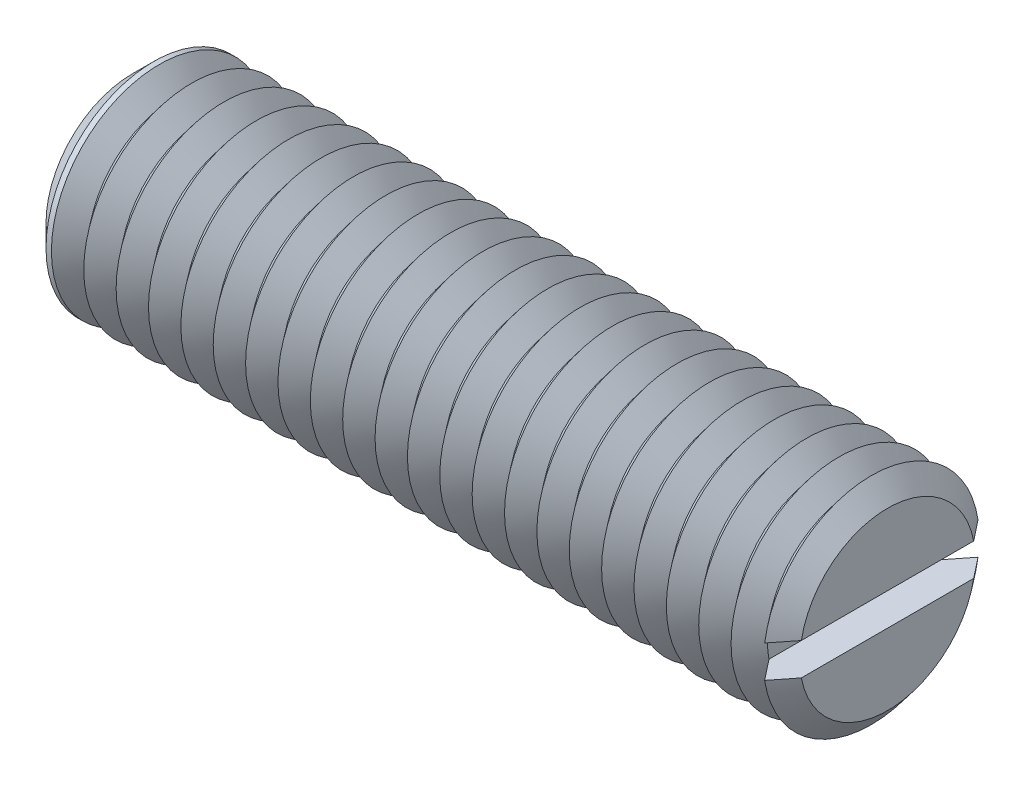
ISO-10303-21;
HEADER;
FILE_DESCRIPTION(('STEP AP214'),'2;1');
FILE_NAME('part.step','',(''),(''),'','','');
FILE_SCHEMA(('AUTOMOTIVE_DESIGN { 1 0 10303 214 1 1 1 1 }'));
ENDSEC;
DATA;
#1=APPLICATION_CONTEXT('core data for automotive mechanical design processes');
#2=APPLICATION_PROTOCOL_DEFINITION('international standard','automotive_design',2000,#1);
#3=PRODUCT_CONTEXT('',#1,'mechanical');
#4=PRODUCT('Part','Part','',(#3));
#5=PRODUCT_RELATED_PRODUCT_CATEGORY('part','',(#4));
#6=PRODUCT_DEFINITION_FORMATION('','',#4);
#7=PRODUCT_DEFINITION_CONTEXT('part definition',#1,'design');
#8=PRODUCT_DEFINITION('design','',#6,#7);
#9=PRODUCT_DEFINITION_SHAPE('','',#8);
#10=(LENGTH_UNIT() NAMED_UNIT(*) SI_UNIT(.MILLI.,.METRE.));
#11=(NAMED_UNIT(*) PLANE_ANGLE_UNIT() SI_UNIT($,.RADIAN.));
#12=(NAMED_UNIT(*) SI_UNIT($,.STERADIAN.) SOLID_ANGLE_UNIT());
#13=UNCERTAINTY_MEASURE_WITH_UNIT(LENGTH_MEASURE(1.E-05),#10,'distance_accuracy_value','');
#14=(GEOMETRIC_REPRESENTATION_CONTEXT(3) GLOBAL_UNCERTAINTY_ASSIGNED_CONTEXT((#13)) GLOBAL_UNIT_ASSIGNED_CONTEXT((#10,
#11,#12)) REPRESENTATION_CONTEXT('',''));
#15=CARTESIAN_POINT('',(0.,0.,0.));
#16=DIRECTION('',(0.,0.,1.));
#17=DIRECTION('',(1.,0.,0.));
#18=AXIS2_PLACEMENT_3D('',#15,#16,#17);
#19=CARTESIAN_POINT('',(16.75,0.,0.));
#20=DIRECTION('',(1.,0.,0.));
#21=DIRECTION('',(0.,0.,-1.));
#22=AXIS2_PLACEMENT_3D('',#19,#20,#21);
#23=CONICAL_SURFACE('',#22,5.,0.895664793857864);
#24=CARTESIAN_POINT('',(16.75,0.,0.));
#25=DIRECTION('',(-1.,0.,0.));
#26=DIRECTION('',(0.,0.,1.));
#27=AXIS2_PLACEMENT_3D('',#24,#25,#26);
#28=CIRCLE('',#27,5.);
#29=CARTESIAN_POINT('',(16.75,-0.75,-4.9434299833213));
#30=VERTEX_POINT('',#29);
#31=CARTESIAN_POINT('',(16.75,-0.75,4.9434299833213));
#32=VERTEX_POINT('',#31);
#33=EDGE_CURVE('E117',#30,#32,#28,.T.);
#34=ORIENTED_EDGE('',*,*,#33,.T.);
#35=CARTESIAN_POINT('',(21.4886555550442,-0.75,-10.8927895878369));
#36=CARTESIAN_POINT('',(21.178663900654,-0.75,-10.5046848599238));
#37=CARTESIAN_POINT('',(20.8687121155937,-0.75,-10.1165482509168));
#38=CARTESIAN_POINT('',(20.2489116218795,-0.75,-9.34012563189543));
#39=CARTESIAN_POINT('',(19.9390629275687,-0.75,-8.95183961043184));
#40=CARTESIAN_POINT('',(19.3189382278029,-0.75,-8.17433811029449));
#41=CARTESIAN_POINT('',(19.0086626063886,-0.75,-7.78512232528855));
#42=CARTESIAN_POINT('',(18.3884400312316,-0.75,-7.00649525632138));
#43=CARTESIAN_POINT('',(18.0784930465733,-0.75,-6.61708399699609));
#44=CARTESIAN_POINT('',(17.6053943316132,-0.75,-6.02191131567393));
#45=CARTESIAN_POINT('',(17.4420627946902,-0.75,-5.81629283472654));
#46=CARTESIAN_POINT('',(17.1155893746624,-0.75,-5.40490151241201));
#47=CARTESIAN_POINT('',(16.9524474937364,-0.75,-5.19912866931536));
#48=CARTESIAN_POINT('',(16.6263799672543,-0.75,-4.7873022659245));
#49=CARTESIAN_POINT('',(16.4634544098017,-0.75,-4.5812486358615));
#50=CARTESIAN_POINT('',(16.138006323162,-0.75,-4.16883695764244));
#51=CARTESIAN_POINT('',(15.9754837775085,-0.75,-3.96247892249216));
#52=CARTESIAN_POINT('',(15.6512888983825,-0.75,-3.54956515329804));
#53=CARTESIAN_POINT('',(15.4896156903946,-0.75,-3.34301010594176));
#54=CARTESIAN_POINT('',(15.1672688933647,-0.75,-2.92906737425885));
#55=CARTESIAN_POINT('',(15.0065954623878,-0.75,-2.72167956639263));
#56=CARTESIAN_POINT('',(14.7671162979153,-0.75,-2.40952296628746));
#57=CARTESIAN_POINT('',(14.687569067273,-0.75,-2.3053235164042));
#58=CARTESIAN_POINT('',(14.5292089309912,-0.75,-2.09636868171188));
#59=CARTESIAN_POINT('',(14.4503960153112,-0.75,-1.99161330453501));
#60=CARTESIAN_POINT('',(14.2939159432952,-0.75,-1.78128982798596));
#61=CARTESIAN_POINT('',(14.2162485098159,-0.75,-1.67572193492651));
#62=CARTESIAN_POINT('',(14.0627483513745,-0.75,-1.46326300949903));
#63=CARTESIAN_POINT('',(13.9869154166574,-0.75,-1.35637213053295));
#64=CARTESIAN_POINT('',(13.8961291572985,-0.75,-1.22407390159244));
#65=CARTESIAN_POINT('',(13.8795740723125,-0.75,-1.19976686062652));
#66=CARTESIAN_POINT('',(13.8466682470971,-0.75,-1.15101442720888));
#67=CARTESIAN_POINT('',(13.8303175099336,-0.75,-1.12656903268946));
#68=CARTESIAN_POINT('',(13.7816161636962,-0.75,-1.05299302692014));
#69=CARTESIAN_POINT('',(13.7496192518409,-0.75,-1.00362669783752));
#70=CARTESIAN_POINT('',(13.6868890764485,-0.75,-0.903957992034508));
#71=CARTESIAN_POINT('',(13.6561584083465,-0.75,-0.853653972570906));
#72=CARTESIAN_POINT('',(13.5966309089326,-0.75,-0.751913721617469));
#73=CARTESIAN_POINT('',(13.5678337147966,-0.75,-0.700477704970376));
#74=CARTESIAN_POINT('',(13.5225435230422,-0.75,-0.613963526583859));
#75=CARTESIAN_POINT('',(13.5052186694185,-0.75,-0.579327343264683));
#76=CARTESIAN_POINT('',(13.4722687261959,-0.75,-0.509265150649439));
#77=CARTESIAN_POINT('',(13.4566439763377,-0.75,-0.473838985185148));
#78=CARTESIAN_POINT('',(13.4132659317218,-0.75,-0.366382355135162));
#79=CARTESIAN_POINT('',(13.3888237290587,-0.75,-0.292842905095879));
#80=CARTESIAN_POINT('',(13.3658405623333,-0.75,-0.189809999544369));
#81=CARTESIAN_POINT('',(13.3606856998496,-0.75,-0.161782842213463));
#82=CARTESIAN_POINT('',(13.3527704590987,-0.75,-0.105398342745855));
#83=CARTESIAN_POINT('',(13.3500088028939,-0.75,-0.0770411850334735));
#84=CARTESIAN_POINT('',(13.3470684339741,-0.75,-0.0202548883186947));
#85=CARTESIAN_POINT('',(13.3468839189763,-0.75,0.00817394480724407));
#86=CARTESIAN_POINT('',(13.3490950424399,-0.75,0.0649322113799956));
#87=CARTESIAN_POINT('',(13.351491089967,-0.75,0.0932616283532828));
#88=CARTESIAN_POINT('',(13.3596937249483,-0.75,0.157351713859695));
#89=CARTESIAN_POINT('',(13.3662565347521,-0.75,0.193015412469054));
#90=CARTESIAN_POINT('',(13.3827020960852,-0.75,0.263573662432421));
#91=CARTESIAN_POINT('',(13.3925874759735,-0.75,0.298467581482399));
#92=CARTESIAN_POINT('',(13.4150598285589,-0.75,0.367652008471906));
#93=CARTESIAN_POINT('',(13.4276667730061,-0.75,0.401935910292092));
#94=CARTESIAN_POINT('',(13.4549130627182,-0.75,0.469664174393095));
#95=CARTESIAN_POINT('',(13.4695519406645,-0.75,0.503108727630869));
#96=CARTESIAN_POINT('',(13.5166350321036,-0.75,0.604259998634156));
#97=CARTESIAN_POINT('',(13.551542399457,-0.75,0.670810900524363));
#98=CARTESIAN_POINT('',(13.6250588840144,-0.75,0.801849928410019));
#99=CARTESIAN_POINT('',(13.6636717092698,-0.75,0.866335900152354));
#100=CARTESIAN_POINT('',(13.7432739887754,-0.75,0.994050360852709));
#101=CARTESIAN_POINT('',(13.784269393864,-0.75,1.057275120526));
#102=CARTESIAN_POINT('',(13.8677403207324,-0.75,1.182741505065));
#103=CARTESIAN_POINT('',(13.9102160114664,-0.75,1.24498301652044));
#104=CARTESIAN_POINT('',(13.9963066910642,-0.75,1.36895722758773));
#105=CARTESIAN_POINT('',(14.0399248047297,-0.75,1.43068775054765));
#106=CARTESIAN_POINT('',(14.1278819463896,-0.75,1.55364126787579));
#107=CARTESIAN_POINT('',(14.172221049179,-0.75,1.61486420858));
#108=CARTESIAN_POINT('',(14.2613408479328,-0.75,1.73681254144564));
#109=CARTESIAN_POINT('',(14.3061205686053,-0.75,1.79753864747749));
#110=CARTESIAN_POINT('',(14.3960732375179,-0.75,1.91869503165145));
#111=CARTESIAN_POINT('',(14.4412461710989,-0.75,1.97912532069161));
#112=CARTESIAN_POINT('',(14.5761092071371,-0.75,2.15860363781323));
#113=CARTESIAN_POINT('',(14.6662359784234,-0.75,2.27732336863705));
#114=CARTESIAN_POINT('',(14.8472315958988,-0.75,2.51419617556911));
#115=CARTESIAN_POINT('',(14.9381004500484,-0.75,2.63234924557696));
#116=CARTESIAN_POINT('',(15.2114512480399,-0.75,2.98624879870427));
#117=CARTESIAN_POINT('',(15.3946699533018,-0.75,3.22142577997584));
#118=CARTESIAN_POINT('',(15.762238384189,-0.75,3.6911794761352));
#119=CARTESIAN_POINT('',(15.9465888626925,-0.75,3.92575559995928));
#120=CARTESIAN_POINT('',(16.31587911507,-0.75,4.39443534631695));
#121=CARTESIAN_POINT('',(16.5008188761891,-0.75,4.62853897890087));
#122=CARTESIAN_POINT('',(16.870331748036,-0.75,5.09551589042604));
#123=CARTESIAN_POINT('',(17.0549033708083,-0.75,5.32839034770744));
#124=CARTESIAN_POINT('',(17.4242990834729,-0.75,5.7939410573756));
#125=CARTESIAN_POINT('',(17.6091231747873,-0.75,6.02661730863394));
#126=CARTESIAN_POINT('',(18.1637745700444,-0.75,6.72433690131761));
#127=CARTESIAN_POINT('',(18.5338620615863,-0.75,7.18917337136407));
#128=CARTESIAN_POINT('',(19.1190458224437,-0.75,7.92356230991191));
#129=CARTESIAN_POINT('',(19.3340169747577,-0.75,8.19321453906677));
#130=CARTESIAN_POINT('',(19.7640698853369,-0.75,8.73245662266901));
#131=CARTESIAN_POINT('',(19.979151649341,-0.75,9.00204647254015));
#132=CARTESIAN_POINT('',(20.4099436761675,-0.75,9.54186292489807));
#133=CARTESIAN_POINT('',(20.6256541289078,-0.75,9.81208937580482));
#134=CARTESIAN_POINT('',(21.0571210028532,-0.75,10.3524795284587));
#135=CARTESIAN_POINT('',(21.2728774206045,-0.75,10.6226432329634));
#136=CARTESIAN_POINT('',(21.4886555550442,-0.75,10.8927895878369));
#137=B_SPLINE_CURVE_WITH_KNOTS('',3,(#35,#36,#37,#38,#39,#40,#41,#42,#43,#44,#45,#46,#47,#48,
#49,#50,#51,#52,#53,#54,#55,#56,#57,#58,#59,#60,#61,#62,#63,#64,#65,#66,#67,#68,#69,#70,#71,#72,
#73,#74,#75,#76,#77,#78,#79,#80,#81,#82,#83,#84,#85,#86,#87,#88,#89,#90,#91,#92,#93,#94,#95,#96,
#97,#98,#99,#100,#101,#102,#103,#104,#105,#106,#107,#108,#109,#110,#111,#112,#113,#114,#115,
#116,#117,#118,#119,#120,#121,#122,#123,#124,#125,#126,#127,#128,#129,#130,#131,#132,#133,#134,
#135,#136),.UNSPECIFIED.,.F.,.F.,(4,2,2,2,2,2,2,2,2,2,2,2,2,2,2,2,2,2,2,2,2,2,2,2,2,2,2,2,2,2,2,
2,2,2,2,2,2,2,2,2,2,2,2,2,2,2,2,2,2,2,4),(0.,1.4901278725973,2.98041311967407,4.47367759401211,
5.96678625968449,6.7545712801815,7.54236526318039,8.33041673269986,9.11843545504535,
9.90534542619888,10.6923767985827,11.0856530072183,11.4789238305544,11.8720978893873,
12.265226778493,12.3534535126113,12.441681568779,12.6181526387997,12.7949690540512,
12.9717521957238,13.0878863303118,13.2040436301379,13.43522465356,13.5206311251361,
13.6059919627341,13.6911605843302,13.7763427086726,13.8849305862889,13.9936045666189,
14.1031049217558,14.2125801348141,14.4377857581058,14.6632191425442,14.8892420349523,
15.1152908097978,15.3420406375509,15.5688141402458,15.7951656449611,16.0215087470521,
16.4686664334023,16.91582892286,17.8101909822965,18.7052318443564,19.6002534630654,
20.4916985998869,21.3831487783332,23.1656575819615,24.2002223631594,25.2348477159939,
26.2721422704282,27.3093757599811),.UNSPECIFIED.);
#138=CARTESIAN_POINT('',(16.,-0.75,3.99343248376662));
#139=VERTEX_POINT('',#138);
#140=EDGE_CURVE('E109',#139,#32,#137,.T.);
#141=ORIENTED_EDGE('',*,*,#140,.F.);
#142=CARTESIAN_POINT('',(16.,0.,0.));
#143=DIRECTION('',(-1.,0.,0.));
#144=DIRECTION('',(0.,0.,1.));
#145=AXIS2_PLACEMENT_3D('',#142,#143,#144);
#146=CIRCLE('',#145,4.06325030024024);
#147=CARTESIAN_POINT('',(16.,-0.75,-3.99343248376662));
#148=VERTEX_POINT('',#147);
#149=EDGE_CURVE('E401',#148,#139,#146,.T.);
#150=ORIENTED_EDGE('',*,*,#149,.F.);
#151=EDGE_CURVE('E58',#30,#148,#137,.T.);
#152=ORIENTED_EDGE('',*,*,#151,.F.);
#153=EDGE_LOOP('',(#34,#141,#150,#152));
#154=FACE_BOUND('',#153,.T.);
#155=ADVANCED_FACE('F37',(#154),#23,.T.);
#156=CARTESIAN_POINT('',(16.75,0.75,4.9434299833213));
#157=VERTEX_POINT('',#156);
#158=CARTESIAN_POINT('',(16.75,0.75,-4.9434299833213));
#159=VERTEX_POINT('',#158);
#160=EDGE_CURVE('E100',#157,#159,#28,.T.);
#161=ORIENTED_EDGE('',*,*,#160,.T.);
#162=CARTESIAN_POINT('',(21.4886555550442,0.75,10.8927895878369));
#163=CARTESIAN_POINT('',(21.178663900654,0.75,10.5046848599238));
#164=CARTESIAN_POINT('',(20.8687121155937,0.75,10.1165482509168));
#165=CARTESIAN_POINT('',(20.2489116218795,0.75,9.34012563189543));
#166=CARTESIAN_POINT('',(19.9390629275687,0.75,8.95183961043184));
#167=CARTESIAN_POINT('',(19.3189382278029,0.75,8.17433811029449));
#168=CARTESIAN_POINT('',(19.0086626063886,0.75,7.78512232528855));
#169=CARTESIAN_POINT('',(18.3884400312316,0.75,7.00649525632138));
#170=CARTESIAN_POINT('',(18.0784930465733,0.75,6.61708399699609));
#171=CARTESIAN_POINT('',(17.6053943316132,0.75,6.02191131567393));
#172=CARTESIAN_POINT('',(17.4420627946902,0.75,5.81629283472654));
#173=CARTESIAN_POINT('',(17.1155893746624,0.75,5.40490151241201));
#174=CARTESIAN_POINT('',(16.9524474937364,0.75,5.19912866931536));
#175=CARTESIAN_POINT('',(16.6263799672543,0.75,4.7873022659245));
#176=CARTESIAN_POINT('',(16.4634544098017,0.75,4.5812486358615));
#177=CARTESIAN_POINT('',(16.138006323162,0.75,4.16883695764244));
#178=CARTESIAN_POINT('',(15.9754837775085,0.75,3.96247892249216));
#179=CARTESIAN_POINT('',(15.6512888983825,0.75,3.54956515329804));
#180=CARTESIAN_POINT('',(15.4896156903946,0.75,3.34301010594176));
#181=CARTESIAN_POINT('',(15.1672688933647,0.75,2.92906737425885));
#182=CARTESIAN_POINT('',(15.0065954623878,0.75,2.72167956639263));
#183=CARTESIAN_POINT('',(14.7671162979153,0.75,2.40952296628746));
#184=CARTESIAN_POINT('',(14.687569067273,0.75,2.3053235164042));
#185=CARTESIAN_POINT('',(14.5292089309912,0.75,2.09636868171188));
#186=CARTESIAN_POINT('',(14.4503960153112,0.75,1.99161330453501));
#187=CARTESIAN_POINT('',(14.2939159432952,0.75,1.78128982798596));
#188=CARTESIAN_POINT('',(14.2162485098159,0.75,1.67572193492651));
#189=CARTESIAN_POINT('',(14.0627483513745,0.75,1.46326300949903));
#190=CARTESIAN_POINT('',(13.9869154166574,0.75,1.35637213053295));
#191=CARTESIAN_POINT('',(13.8961291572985,0.75,1.22407390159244));
#192=CARTESIAN_POINT('',(13.8795740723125,0.75,1.19976686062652));
#193=CARTESIAN_POINT('',(13.8466682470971,0.75,1.15101442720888));
#194=CARTESIAN_POINT('',(13.8303175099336,0.75,1.12656903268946));
#195=CARTESIAN_POINT('',(13.7816161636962,0.75,1.05299302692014));
#196=CARTESIAN_POINT('',(13.7496192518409,0.75,1.00362669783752));
#197=CARTESIAN_POINT('',(13.6868890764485,0.75,0.903957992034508));
#198=CARTESIAN_POINT('',(13.6561584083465,0.75,0.853653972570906));
#199=CARTESIAN_POINT('',(13.5966309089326,0.75,0.751913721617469));
#200=CARTESIAN_POINT('',(13.5678337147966,0.75,0.700477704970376));
#201=CARTESIAN_POINT('',(13.5225435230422,0.75,0.613963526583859));
#202=CARTESIAN_POINT('',(13.5052186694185,0.75,0.579327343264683));
#203=CARTESIAN_POINT('',(13.4722687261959,0.75,0.509265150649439));
#204=CARTESIAN_POINT('',(13.4566439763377,0.75,0.473838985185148));
#205=CARTESIAN_POINT('',(13.4132659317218,0.75,0.366382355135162));
#206=CARTESIAN_POINT('',(13.3888237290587,0.75,0.292842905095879));
#207=CARTESIAN_POINT('',(13.3658405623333,0.75,0.189809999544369));
#208=CARTESIAN_POINT('',(13.3606856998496,0.75,0.161782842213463));
#209=CARTESIAN_POINT('',(13.3527704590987,0.75,0.105398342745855));
#210=CARTESIAN_POINT('',(13.3500088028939,0.75,0.0770411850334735));
#211=CARTESIAN_POINT('',(13.3470684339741,0.75,0.0202548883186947));
#212=CARTESIAN_POINT('',(13.3468839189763,0.75,-0.00817394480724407));
#213=CARTESIAN_POINT('',(13.3490950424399,0.75,-0.0649322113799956));
#214=CARTESIAN_POINT('',(13.351491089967,0.75,-0.0932616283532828));
#215=CARTESIAN_POINT('',(13.3596937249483,0.75,-0.157351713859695));
#216=CARTESIAN_POINT('',(13.3662565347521,0.75,-0.193015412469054));
#217=CARTESIAN_POINT('',(13.3827020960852,0.75,-0.263573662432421));
#218=CARTESIAN_POINT('',(13.3925874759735,0.75,-0.298467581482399));
#219=CARTESIAN_POINT('',(13.4150598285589,0.75,-0.367652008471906));
#220=CARTESIAN_POINT('',(13.4276667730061,0.75,-0.401935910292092));
#221=CARTESIAN_POINT('',(13.4549130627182,0.75,-0.469664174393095));
#222=CARTESIAN_POINT('',(13.4695519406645,0.75,-0.503108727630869));
#223=CARTESIAN_POINT('',(13.5166350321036,0.75,-0.604259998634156));
#224=CARTESIAN_POINT('',(13.551542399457,0.75,-0.670810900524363));
#225=CARTESIAN_POINT('',(13.6250588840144,0.75,-0.801849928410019));
#226=CARTESIAN_POINT('',(13.6636717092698,0.75,-0.866335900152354));
#227=CARTESIAN_POINT('',(13.7432739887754,0.75,-0.994050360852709));
#228=CARTESIAN_POINT('',(13.784269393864,0.75,-1.057275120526));
#229=CARTESIAN_POINT('',(13.8677403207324,0.75,-1.182741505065));
#230=CARTESIAN_POINT('',(13.9102160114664,0.75,-1.24498301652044));
#231=CARTESIAN_POINT('',(13.9963066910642,0.75,-1.36895722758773));
#232=CARTESIAN_POINT('',(14.0399248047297,0.75,-1.43068775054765));
#233=CARTESIAN_POINT('',(14.1278819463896,0.75,-1.55364126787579));
#234=CARTESIAN_POINT('',(14.172221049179,0.75,-1.61486420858));
#235=CARTESIAN_POINT('',(14.2613408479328,0.75,-1.73681254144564));
#236=CARTESIAN_POINT('',(14.3061205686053,0.75,-1.79753864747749));
#237=CARTESIAN_POINT('',(14.3960732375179,0.75,-1.91869503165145));
#238=CARTESIAN_POINT('',(14.4412461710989,0.75,-1.97912532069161));
#239=CARTESIAN_POINT('',(14.5761092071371,0.75,-2.15860363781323));
#240=CARTESIAN_POINT('',(14.6662359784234,0.75,-2.27732336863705));
#241=CARTESIAN_POINT('',(14.8472315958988,0.75,-2.51419617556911));
#242=CARTESIAN_POINT('',(14.9381004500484,0.75,-2.63234924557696));
#243=CARTESIAN_POINT('',(15.2114512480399,0.75,-2.98624879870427));
#244=CARTESIAN_POINT('',(15.3946699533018,0.75,-3.22142577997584));
#245=CARTESIAN_POINT('',(15.762238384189,0.75,-3.6911794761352));
#246=CARTESIAN_POINT('',(15.9465888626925,0.75,-3.92575559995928));
#247=CARTESIAN_POINT('',(16.31587911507,0.75,-4.39443534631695));
#248=CARTESIAN_POINT('',(16.5008188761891,0.75,-4.62853897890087));
#249=CARTESIAN_POINT('',(16.870331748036,0.75,-5.09551589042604));
#250=CARTESIAN_POINT('',(17.0549033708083,0.75,-5.32839034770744));
#251=CARTESIAN_POINT('',(17.4242990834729,0.75,-5.7939410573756));
#252=CARTESIAN_POINT('',(17.6091231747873,0.75,-6.02661730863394));
#253=CARTESIAN_POINT('',(18.1637745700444,0.75,-6.72433690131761));
#254=CARTESIAN_POINT('',(18.5338620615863,0.75,-7.18917337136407));
#255=CARTESIAN_POINT('',(19.1190458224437,0.75,-7.92356230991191));
#256=CARTESIAN_POINT('',(19.3340169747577,0.75,-8.19321453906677));
#257=CARTESIAN_POINT('',(19.7640698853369,0.75,-8.73245662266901));
#258=CARTESIAN_POINT('',(19.979151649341,0.75,-9.00204647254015));
#259=CARTESIAN_POINT('',(20.4099436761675,0.75,-9.54186292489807));
#260=CARTESIAN_POINT('',(20.6256541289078,0.75,-9.81208937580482));
#261=CARTESIAN_POINT('',(21.0571210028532,0.75,-10.3524795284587));
#262=CARTESIAN_POINT('',(21.2728774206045,0.75,-10.6226432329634));
#263=CARTESIAN_POINT('',(21.4886555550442,0.75,-10.8927895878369));
#264=B_SPLINE_CURVE_WITH_KNOTS('',3,(#162,#163,#164,#165,#166,#167,#168,#169,#170,#171,#172,
#173,#174,#175,#176,#177,#178,#179,#180,#181,#182,#183,#184,#185,#186,#187,#188,#189,#190,#191,
#192,#193,#194,#195,#196,#197,#198,#199,#200,#201,#202,#203,#204,#205,#206,#207,#208,#209,#210,
#211,#212,#213,#214,#215,#216,#217,#218,#219,#220,#221,#222,#223,#224,#225,#226,#227,#228,#229,
#230,#231,#232,#233,#234,#235,#236,#237,#238,#239,#240,#241,#242,#243,#244,#245,#246,#247,#248,
#249,#250,#251,#252,#253,#254,#255,#256,#257,#258,#259,#260,#261,#262,#263),.UNSPECIFIED.,.F.,
.F.,(4,2,2,2,2,2,2,2,2,2,2,2,2,2,2,2,2,2,2,2,2,2,2,2,2,2,2,2,2,2,2,2,2,2,2,2,2,2,2,2,2,2,2,2,2,
2,2,2,2,2,4),(0.,1.4901278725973,2.98041311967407,4.47367759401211,5.96678625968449,
6.7545712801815,7.54236526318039,8.33041673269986,9.11843545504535,9.90534542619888,
10.6923767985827,11.0856530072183,11.4789238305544,11.8720978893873,12.265226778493,
12.3534535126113,12.441681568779,12.6181526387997,12.7949690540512,12.9717521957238,
13.0878863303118,13.2040436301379,13.43522465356,13.5206311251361,13.6059919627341,
13.6911605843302,13.7763427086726,13.8849305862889,13.9936045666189,14.1031049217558,
14.2125801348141,14.4377857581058,14.6632191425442,14.8892420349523,15.1152908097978,
15.3420406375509,15.5688141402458,15.7951656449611,16.0215087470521,16.4686664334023,
16.91582892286,17.8101909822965,18.7052318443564,19.6002534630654,20.4916985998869,
21.3831487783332,23.1656575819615,24.2002223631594,25.2348477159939,26.2721422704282,
27.3093757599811),.UNSPECIFIED.);
#265=CARTESIAN_POINT('',(16.,0.75,-3.99343248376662));
#266=VERTEX_POINT('',#265);
#267=EDGE_CURVE('E110',#266,#159,#264,.T.);
#268=ORIENTED_EDGE('',*,*,#267,.F.);
#269=CARTESIAN_POINT('',(16.,0.75,3.99343248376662));
#270=VERTEX_POINT('',#269);
#271=EDGE_CURVE('E103',#270,#266,#146,.T.);
#272=ORIENTED_EDGE('',*,*,#271,.F.);
#273=EDGE_CURVE('E97',#157,#270,#264,.T.);
#274=ORIENTED_EDGE('',*,*,#273,.F.);
#275=EDGE_LOOP('',(#161,#268,#272,#274));
#276=FACE_BOUND('',#275,.T.);
#277=ADVANCED_FACE('F99',(#276),#23,.T.);
#278=CARTESIAN_POINT('',(16.,0.,0.));
#279=DIRECTION('',(-1.,0.,0.));
#280=DIRECTION('',(0.,0.,1.));
#281=AXIS2_PLACEMENT_3D('',#278,#279,#280);
#282=CONICAL_SURFACE('',#281,4.06325030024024,0.895664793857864);
#283=CARTESIAN_POINT('',(15.25,0.,0.));
#284=DIRECTION('',(-1.,0.,0.));
#285=DIRECTION('',(0.,0.,1.));
#286=AXIS2_PLACEMENT_3D('',#283,#284,#285);
#287=CIRCLE('',#286,5.);
#288=CARTESIAN_POINT('',(15.25,0.,5.));
#289=VERTEX_POINT('',#288);
#290=EDGE_CURVE('E387',#289,#289,#287,.T.);
#291=ORIENTED_EDGE('',*,*,#290,.F.);
#292=EDGE_LOOP('',(#291));
#293=FACE_BOUND('',#292,.T.);
#294=ORIENTED_EDGE('',*,*,#271,.T.);
#295=EDGE_CURVE('E396',#266,#148,#146,.T.);
#296=ORIENTED_EDGE('',*,*,#295,.T.);
#297=ORIENTED_EDGE('',*,*,#149,.T.);
#298=EDGE_CURVE('E394',#139,#270,#146,.T.);
#299=ORIENTED_EDGE('',*,*,#298,.T.);
#300=EDGE_LOOP('',(#294,#296,#297,#299));
#301=FACE_BOUND('',#300,.T.);
#302=ADVANCED_FACE('F168',(#293,#301),#282,.T.);
#303=CARTESIAN_POINT('',(17.5,0.,0.));
#304=DIRECTION('',(1.,0.,0.));
#305=DIRECTION('',(0.,0.,-1.));
#306=AXIS2_PLACEMENT_3D('',#303,#304,#305);
#307=PLANE('',#306);
#308=CARTESIAN_POINT('',(17.5,0.,0.));
#309=DIRECTION('',(-1.,0.,0.));
#310=DIRECTION('',(0.,0.,1.));
#311=AXIS2_PLACEMENT_3D('',#308,#309,#310);
#312=CIRCLE('',#311,4.06325030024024);
#313=CARTESIAN_POINT('',(17.5,0.75,3.99343248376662));
#314=VERTEX_POINT('',#313);
#315=CARTESIAN_POINT('',(17.5,0.75,-3.99343248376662));
#316=VERTEX_POINT('',#315);
#317=EDGE_CURVE('E160',#314,#316,#312,.T.);
#318=ORIENTED_EDGE('',*,*,#317,.F.);
#319=DIRECTION('',(0.,0.,1.));
#320=VECTOR('',#319,1.);
#321=CARTESIAN_POINT('',(17.5,0.75,0.));
#322=LINE('',#321,#320);
#323=EDGE_CURVE('E122',#316,#314,#322,.T.);
#324=ORIENTED_EDGE('',*,*,#323,.F.);
#325=EDGE_LOOP('',(#318,#324));
#326=FACE_BOUND('',#325,.T.);
#327=ADVANCED_FACE('F172',(#326),#307,.T.);
#328=CARTESIAN_POINT('',(17.5,-0.75,-3.99343248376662));
#329=VERTEX_POINT('',#328);
#330=CARTESIAN_POINT('',(17.5,-0.75,3.99343248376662));
#331=VERTEX_POINT('',#330);
#332=EDGE_CURVE('E66',#329,#331,#312,.T.);
#333=ORIENTED_EDGE('',*,*,#332,.F.);
#334=DIRECTION('',(0.,0.,-1.));
#335=VECTOR('',#334,1.);
#336=CARTESIAN_POINT('',(17.5,-0.75,0.));
#337=LINE('',#336,#335);
#338=EDGE_CURVE('E136',#331,#329,#337,.T.);
#339=ORIENTED_EDGE('',*,*,#338,.F.);
#340=EDGE_LOOP('',(#333,#339));
#341=FACE_BOUND('',#340,.T.);
#342=ADVANCED_FACE('F200',(#341),#307,.T.);
#343=CARTESIAN_POINT('',(17.5,0.,0.));
#344=DIRECTION('',(-1.,0.,0.));
#345=DIRECTION('',(0.,0.,1.));
#346=AXIS2_PLACEMENT_3D('',#343,#344,#345);
#347=CONICAL_SURFACE('',#346,4.06325030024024,0.895664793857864);
#348=ORIENTED_EDGE('',*,*,#160,.F.);
#349=CARTESIAN_POINT('',(12.0113444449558,0.75,-10.8927895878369));
#350=CARTESIAN_POINT('',(12.321336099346,0.75,-10.5046848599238));
#351=CARTESIAN_POINT('',(12.6312878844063,0.75,-10.1165482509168));
#352=CARTESIAN_POINT('',(13.2510883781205,0.75,-9.34012563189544));
#353=CARTESIAN_POINT('',(13.5609370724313,0.75,-8.95183961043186));
#354=CARTESIAN_POINT('',(14.1810617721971,0.75,-8.17433811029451));
#355=CARTESIAN_POINT('',(14.4913373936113,0.75,-7.78512232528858));
#356=CARTESIAN_POINT('',(15.1115599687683,0.75,-7.00649525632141));
#357=CARTESIAN_POINT('',(15.4215069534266,0.75,-6.61708399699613));
#358=CARTESIAN_POINT('',(15.8946056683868,0.75,-6.02191131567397));
#359=CARTESIAN_POINT('',(16.0579372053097,0.75,-5.81629283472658));
#360=CARTESIAN_POINT('',(16.3844106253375,0.75,-5.40490151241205));
#361=CARTESIAN_POINT('',(16.5475525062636,0.75,-5.19912866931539));
#362=CARTESIAN_POINT('',(16.8736200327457,0.75,-4.78730226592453));
#363=CARTESIAN_POINT('',(17.0365455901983,0.75,-4.58124863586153));
#364=CARTESIAN_POINT('',(17.361993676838,0.75,-4.16883695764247));
#365=CARTESIAN_POINT('',(17.5245162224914,0.75,-3.96247892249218));
#366=CARTESIAN_POINT('',(17.8487111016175,0.75,-3.54956515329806));
#367=CARTESIAN_POINT('',(18.0103843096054,0.75,-3.34301010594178));
#368=CARTESIAN_POINT('',(18.3327311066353,0.75,-2.92906737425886));
#369=CARTESIAN_POINT('',(18.4934045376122,0.75,-2.72167956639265));
#370=CARTESIAN_POINT('',(18.7328837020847,0.75,-2.40952296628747));
#371=CARTESIAN_POINT('',(18.812430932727,0.75,-2.30532351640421));
#372=CARTESIAN_POINT('',(18.9707910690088,0.75,-2.09636868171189));
#373=CARTESIAN_POINT('',(19.0496039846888,0.75,-1.99161330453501));
#374=CARTESIAN_POINT('',(19.2060840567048,0.75,-1.78128982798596));
#375=CARTESIAN_POINT('',(19.2837514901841,0.75,-1.67572193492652));
#376=CARTESIAN_POINT('',(19.4372516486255,0.75,-1.46326300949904));
#377=CARTESIAN_POINT('',(19.5130845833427,0.75,-1.35637213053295));
#378=CARTESIAN_POINT('',(19.6038708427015,0.75,-1.22407390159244));
#379=CARTESIAN_POINT('',(19.6204259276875,0.75,-1.19976686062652));
#380=CARTESIAN_POINT('',(19.6533317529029,0.75,-1.15101442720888));
#381=CARTESIAN_POINT('',(19.6696824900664,0.75,-1.12656903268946));
#382=CARTESIAN_POINT('',(19.7183838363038,0.75,-1.05299302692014));
#383=CARTESIAN_POINT('',(19.7503807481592,0.75,-1.00362669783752));
#384=CARTESIAN_POINT('',(19.8131109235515,0.75,-0.903957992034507));
#385=CARTESIAN_POINT('',(19.8438415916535,0.75,-0.853653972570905));
#386=CARTESIAN_POINT('',(19.9033690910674,0.75,-0.751913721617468));
#387=CARTESIAN_POINT('',(19.9321662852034,0.75,-0.700477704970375));
#388=CARTESIAN_POINT('',(19.9774564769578,0.75,-0.613963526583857));
#389=CARTESIAN_POINT('',(19.9947813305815,0.75,-0.579327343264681));
#390=CARTESIAN_POINT('',(20.0277312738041,0.75,-0.509265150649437));
#391=CARTESIAN_POINT('',(20.0433560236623,0.75,-0.473838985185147));
#392=CARTESIAN_POINT('',(20.0867340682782,0.75,-0.366382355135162));
#393=CARTESIAN_POINT('',(20.1111762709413,0.75,-0.292842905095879));
#394=CARTESIAN_POINT('',(20.1341594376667,0.75,-0.189809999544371));
#395=CARTESIAN_POINT('',(20.1393143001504,0.75,-0.161782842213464));
#396=CARTESIAN_POINT('',(20.1472295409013,0.75,-0.105398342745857));
#397=CARTESIAN_POINT('',(20.1499911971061,0.75,-0.0770411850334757));
#398=CARTESIAN_POINT('',(20.1529315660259,0.75,-0.0202548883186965));
#399=CARTESIAN_POINT('',(20.1531160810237,0.75,0.00817394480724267));
#400=CARTESIAN_POINT('',(20.1509049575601,0.75,0.0649322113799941));
#401=CARTESIAN_POINT('',(20.148508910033,0.75,0.0932616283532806));
#402=CARTESIAN_POINT('',(20.1403062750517,0.75,0.157351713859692));
#403=CARTESIAN_POINT('',(20.1337434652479,0.75,0.19301541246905));
#404=CARTESIAN_POINT('',(20.1172979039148,0.75,0.263573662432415));
#405=CARTESIAN_POINT('',(20.1074125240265,0.75,0.298467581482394));
#406=CARTESIAN_POINT('',(20.0849401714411,0.75,0.367652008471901));
#407=CARTESIAN_POINT('',(20.0723332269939,0.75,0.401935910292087));
#408=CARTESIAN_POINT('',(20.0450869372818,0.75,0.46966417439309));
#409=CARTESIAN_POINT('',(20.0304480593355,0.75,0.503108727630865));
#410=CARTESIAN_POINT('',(19.9833649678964,0.75,0.604259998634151));
#411=CARTESIAN_POINT('',(19.948457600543,0.75,0.670810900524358));
#412=CARTESIAN_POINT('',(19.8749411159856,0.75,0.801849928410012));
#413=CARTESIAN_POINT('',(19.8363282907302,0.75,0.866335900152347));
#414=CARTESIAN_POINT('',(19.7567260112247,0.75,0.994050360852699));
#415=CARTESIAN_POINT('',(19.7157306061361,0.75,1.05727512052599));
#416=CARTESIAN_POINT('',(19.6322596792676,0.75,1.18274150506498));
#417=CARTESIAN_POINT('',(19.5897839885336,0.75,1.24498301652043));
#418=CARTESIAN_POINT('',(19.5036933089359,0.75,1.36895722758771));
#419=CARTESIAN_POINT('',(19.4600751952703,0.75,1.43068775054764));
#420=CARTESIAN_POINT('',(19.3721180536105,0.75,1.55364126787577));
#421=CARTESIAN_POINT('',(19.327778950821,0.75,1.61486420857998));
#422=CARTESIAN_POINT('',(19.2386591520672,0.75,1.73681254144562));
#423=CARTESIAN_POINT('',(19.1938794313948,0.75,1.79753864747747));
#424=CARTESIAN_POINT('',(19.1039267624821,0.75,1.91869503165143));
#425=CARTESIAN_POINT('',(19.0587538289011,0.75,1.97912532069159));
#426=CARTESIAN_POINT('',(18.923890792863,0.75,2.1586036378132));
#427=CARTESIAN_POINT('',(18.8337640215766,0.75,2.27732336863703));
#428=CARTESIAN_POINT('',(18.6527684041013,0.75,2.51419617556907));
#429=CARTESIAN_POINT('',(18.5618995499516,0.75,2.63234924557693));
#430=CARTESIAN_POINT('',(18.2885487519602,0.75,2.98624879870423));
#431=CARTESIAN_POINT('',(18.1053300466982,0.75,3.2214257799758));
#432=CARTESIAN_POINT('',(17.737761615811,0.75,3.69117947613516));
#433=CARTESIAN_POINT('',(17.5534111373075,0.75,3.92575559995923));
#434=CARTESIAN_POINT('',(17.18412088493,0.75,4.39443534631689));
#435=CARTESIAN_POINT('',(16.999181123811,0.75,4.62853897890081));
#436=CARTESIAN_POINT('',(16.629668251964,0.75,5.09551589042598));
#437=CARTESIAN_POINT('',(16.4450966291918,0.75,5.32839034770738));
#438=CARTESIAN_POINT('',(16.0757009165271,0.75,5.79394105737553));
#439=CARTESIAN_POINT('',(15.8908768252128,0.75,6.02661730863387));
#440=CARTESIAN_POINT('',(15.3362254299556,0.75,6.72433690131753));
#441=CARTESIAN_POINT('',(14.9661379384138,0.75,7.18917337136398));
#442=CARTESIAN_POINT('',(14.3809541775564,0.75,7.92356230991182));
#443=CARTESIAN_POINT('',(14.1659830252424,0.75,8.19321453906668));
#444=CARTESIAN_POINT('',(13.7359301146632,0.75,8.73245662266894));
#445=CARTESIAN_POINT('',(13.520848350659,0.75,9.00204647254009));
#446=CARTESIAN_POINT('',(13.0900563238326,0.75,9.54186292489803));
#447=CARTESIAN_POINT('',(12.8743458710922,0.75,9.81208937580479));
#448=CARTESIAN_POINT('',(12.4428789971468,0.75,10.3524795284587));
#449=CARTESIAN_POINT('',(12.2271225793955,0.75,10.6226432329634));
#450=CARTESIAN_POINT('',(12.0113444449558,0.75,10.8927895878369));
#451=B_SPLINE_CURVE_WITH_KNOTS('',3,(#349,#350,#351,#352,#353,#354,#355,#356,#357,#358,#359,
#360,#361,#362,#363,#364,#365,#366,#367,#368,#369,#370,#371,#372,#373,#374,#375,#376,#377,#378,
#379,#380,#381,#382,#383,#384,#385,#386,#387,#388,#389,#390,#391,#392,#393,#394,#395,#396,#397,
#398,#399,#400,#401,#402,#403,#404,#405,#406,#407,#408,#409,#410,#411,#412,#413,#414,#415,#416,
#417,#418,#419,#420,#421,#422,#423,#424,#425,#426,#427,#428,#429,#430,#431,#432,#433,#434,#435,
#436,#437,#438,#439,#440,#441,#442,#443,#444,#445,#446,#447,#448,#449,#450),.UNSPECIFIED.,.F.,
.F.,(4,2,2,2,2,2,2,2,2,2,2,2,2,2,2,2,2,2,2,2,2,2,2,2,2,2,2,2,2,2,2,2,2,2,2,2,2,2,2,2,2,2,2,2,2,
2,2,2,2,2,4),(0.,1.49012787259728,2.98041311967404,4.47367759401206,5.96678625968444,
6.75457128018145,7.54236526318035,8.33041673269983,9.11843545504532,9.90534542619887,
10.6923767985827,11.0856530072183,11.4789238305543,11.8720978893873,12.265226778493,
12.3534535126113,12.441681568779,12.6181526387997,12.7949690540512,12.9717521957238,
13.0878863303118,13.2040436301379,13.43522465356,13.5206311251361,13.6059919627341,
13.6911605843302,13.7763427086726,13.8849305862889,13.9936045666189,14.1031049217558,
14.2125801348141,14.4377857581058,14.6632191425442,14.8892420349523,15.1152908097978,
15.3420406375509,15.5688141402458,15.795165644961,16.0215087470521,16.4686664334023,
16.91582892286,17.8101909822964,18.7052318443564,19.6002534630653,20.4916985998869,
21.3831487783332,23.1656575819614,24.2002223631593,25.2348477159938,26.2721422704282,
27.3093757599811),.UNSPECIFIED.);
#452=EDGE_CURVE('E41',#314,#157,#451,.T.);
#453=ORIENTED_EDGE('',*,*,#452,.F.);
#454=ORIENTED_EDGE('',*,*,#317,.T.);
#455=EDGE_CURVE('E11',#159,#316,#451,.T.);
#456=ORIENTED_EDGE('',*,*,#455,.F.);
#457=EDGE_LOOP('',(#348,#453,#454,#456));
#458=FACE_BOUND('',#457,.T.);
#459=ADVANCED_FACE('F114',(#458),#347,.T.);
#460=CARTESIAN_POINT('',(17.5,0.75,-7.5));
#461=DIRECTION('',(0.,1.,0.));
#462=DIRECTION('',(0.,0.,1.));
#463=AXIS2_PLACEMENT_3D('',#460,#461,#462);
#464=PLANE('',#463);
#465=ORIENTED_EDGE('',*,*,#452,.T.);
#466=ORIENTED_EDGE('',*,*,#273,.T.);
#467=DIRECTION('',(0.,0.,1.));
#468=VECTOR('',#467,1.);
#469=CARTESIAN_POINT('',(16.,0.75,-7.5));
#470=LINE('',#469,#468);
#471=EDGE_CURVE('E145',#266,#270,#470,.T.);
#472=ORIENTED_EDGE('',*,*,#471,.F.);
#473=ORIENTED_EDGE('',*,*,#267,.T.);
#474=ORIENTED_EDGE('',*,*,#455,.T.);
#475=ORIENTED_EDGE('',*,*,#323,.T.);
#476=EDGE_LOOP('',(#465,#466,#472,#473,#474,#475));
#477=FACE_BOUND('',#476,.T.);
#478=ADVANCED_FACE('F120',(#477),#464,.F.);
#479=ORIENTED_EDGE('',*,*,#33,.F.);
#480=CARTESIAN_POINT('',(12.0113444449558,-0.75,10.8927895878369));
#481=CARTESIAN_POINT('',(12.321336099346,-0.75,10.5046848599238));
#482=CARTESIAN_POINT('',(12.6312878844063,-0.75,10.1165482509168));
#483=CARTESIAN_POINT('',(13.2510883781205,-0.75,9.34012563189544));
#484=CARTESIAN_POINT('',(13.5609370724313,-0.75,8.95183961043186));
#485=CARTESIAN_POINT('',(14.1810617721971,-0.75,8.17433811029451));
#486=CARTESIAN_POINT('',(14.4913373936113,-0.75,7.78512232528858));
#487=CARTESIAN_POINT('',(15.1115599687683,-0.75,7.00649525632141));
#488=CARTESIAN_POINT('',(15.4215069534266,-0.75,6.61708399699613));
#489=CARTESIAN_POINT('',(15.8946056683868,-0.75,6.02191131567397));
#490=CARTESIAN_POINT('',(16.0579372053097,-0.75,5.81629283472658));
#491=CARTESIAN_POINT('',(16.3844106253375,-0.75,5.40490151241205));
#492=CARTESIAN_POINT('',(16.5475525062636,-0.75,5.19912866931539));
#493=CARTESIAN_POINT('',(16.8736200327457,-0.75,4.78730226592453));
#494=CARTESIAN_POINT('',(17.0365455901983,-0.75,4.58124863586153));
#495=CARTESIAN_POINT('',(17.361993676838,-0.75,4.16883695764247));
#496=CARTESIAN_POINT('',(17.5245162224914,-0.75,3.96247892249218));
#497=CARTESIAN_POINT('',(17.8487111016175,-0.75,3.54956515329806));
#498=CARTESIAN_POINT('',(18.0103843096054,-0.75,3.34301010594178));
#499=CARTESIAN_POINT('',(18.3327311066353,-0.75,2.92906737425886));
#500=CARTESIAN_POINT('',(18.4934045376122,-0.75,2.72167956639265));
#501=CARTESIAN_POINT('',(18.7328837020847,-0.75,2.40952296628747));
#502=CARTESIAN_POINT('',(18.812430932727,-0.75,2.30532351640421));
#503=CARTESIAN_POINT('',(18.9707910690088,-0.75,2.09636868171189));
#504=CARTESIAN_POINT('',(19.0496039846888,-0.75,1.99161330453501));
#505=CARTESIAN_POINT('',(19.2060840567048,-0.75,1.78128982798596));
#506=CARTESIAN_POINT('',(19.2837514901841,-0.75,1.67572193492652));
#507=CARTESIAN_POINT('',(19.4372516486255,-0.75,1.46326300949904));
#508=CARTESIAN_POINT('',(19.5130845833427,-0.75,1.35637213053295));
#509=CARTESIAN_POINT('',(19.6038708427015,-0.75,1.22407390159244));
#510=CARTESIAN_POINT('',(19.6204259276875,-0.75,1.19976686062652));
#511=CARTESIAN_POINT('',(19.6533317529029,-0.75,1.15101442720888));
#512=CARTESIAN_POINT('',(19.6696824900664,-0.75,1.12656903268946));
#513=CARTESIAN_POINT('',(19.7183838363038,-0.75,1.05299302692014));
#514=CARTESIAN_POINT('',(19.7503807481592,-0.75,1.00362669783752));
#515=CARTESIAN_POINT('',(19.8131109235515,-0.75,0.903957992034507));
#516=CARTESIAN_POINT('',(19.8438415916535,-0.75,0.853653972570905));
#517=CARTESIAN_POINT('',(19.9033690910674,-0.75,0.751913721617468));
#518=CARTESIAN_POINT('',(19.9321662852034,-0.75,0.700477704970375));
#519=CARTESIAN_POINT('',(19.9774564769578,-0.75,0.613963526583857));
#520=CARTESIAN_POINT('',(19.9947813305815,-0.75,0.579327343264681));
#521=CARTESIAN_POINT('',(20.0277312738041,-0.75,0.509265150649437));
#522=CARTESIAN_POINT('',(20.0433560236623,-0.75,0.473838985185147));
#523=CARTESIAN_POINT('',(20.0867340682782,-0.75,0.366382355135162));
#524=CARTESIAN_POINT('',(20.1111762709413,-0.75,0.292842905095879));
#525=CARTESIAN_POINT('',(20.1341594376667,-0.75,0.189809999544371));
#526=CARTESIAN_POINT('',(20.1393143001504,-0.75,0.161782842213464));
#527=CARTESIAN_POINT('',(20.1472295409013,-0.75,0.105398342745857));
#528=CARTESIAN_POINT('',(20.1499911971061,-0.75,0.0770411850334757));
#529=CARTESIAN_POINT('',(20.1529315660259,-0.75,0.0202548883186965));
#530=CARTESIAN_POINT('',(20.1531160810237,-0.75,-0.00817394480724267));
#531=CARTESIAN_POINT('',(20.1509049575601,-0.75,-0.0649322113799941));
#532=CARTESIAN_POINT('',(20.148508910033,-0.75,-0.0932616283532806));
#533=CARTESIAN_POINT('',(20.1403062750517,-0.75,-0.157351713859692));
#534=CARTESIAN_POINT('',(20.1337434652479,-0.75,-0.19301541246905));
#535=CARTESIAN_POINT('',(20.1172979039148,-0.75,-0.263573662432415));
#536=CARTESIAN_POINT('',(20.1074125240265,-0.75,-0.298467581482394));
#537=CARTESIAN_POINT('',(20.0849401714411,-0.75,-0.367652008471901));
#538=CARTESIAN_POINT('',(20.0723332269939,-0.75,-0.401935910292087));
#539=CARTESIAN_POINT('',(20.0450869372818,-0.75,-0.46966417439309));
#540=CARTESIAN_POINT('',(20.0304480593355,-0.75,-0.503108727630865));
#541=CARTESIAN_POINT('',(19.9833649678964,-0.75,-0.604259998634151));
#542=CARTESIAN_POINT('',(19.948457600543,-0.75,-0.670810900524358));
#543=CARTESIAN_POINT('',(19.8749411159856,-0.75,-0.801849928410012));
#544=CARTESIAN_POINT('',(19.8363282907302,-0.75,-0.866335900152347));
#545=CARTESIAN_POINT('',(19.7567260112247,-0.75,-0.994050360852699));
#546=CARTESIAN_POINT('',(19.7157306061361,-0.75,-1.05727512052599));
#547=CARTESIAN_POINT('',(19.6322596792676,-0.75,-1.18274150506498));
#548=CARTESIAN_POINT('',(19.5897839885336,-0.75,-1.24498301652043));
#549=CARTESIAN_POINT('',(19.5036933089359,-0.75,-1.36895722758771));
#550=CARTESIAN_POINT('',(19.4600751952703,-0.75,-1.43068775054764));
#551=CARTESIAN_POINT('',(19.3721180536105,-0.75,-1.55364126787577));
#552=CARTESIAN_POINT('',(19.327778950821,-0.75,-1.61486420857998));
#553=CARTESIAN_POINT('',(19.2386591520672,-0.75,-1.73681254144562));
#554=CARTESIAN_POINT('',(19.1938794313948,-0.75,-1.79753864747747));
#555=CARTESIAN_POINT('',(19.1039267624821,-0.75,-1.91869503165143));
#556=CARTESIAN_POINT('',(19.0587538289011,-0.75,-1.97912532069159));
#557=CARTESIAN_POINT('',(18.923890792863,-0.75,-2.1586036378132));
#558=CARTESIAN_POINT('',(18.8337640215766,-0.75,-2.27732336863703));
#559=CARTESIAN_POINT('',(18.6527684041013,-0.75,-2.51419617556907));
#560=CARTESIAN_POINT('',(18.5618995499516,-0.75,-2.63234924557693));
#561=CARTESIAN_POINT('',(18.2885487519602,-0.75,-2.98624879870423));
#562=CARTESIAN_POINT('',(18.1053300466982,-0.75,-3.2214257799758));
#563=CARTESIAN_POINT('',(17.737761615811,-0.75,-3.69117947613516));
#564=CARTESIAN_POINT('',(17.5534111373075,-0.75,-3.92575559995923));
#565=CARTESIAN_POINT('',(17.18412088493,-0.75,-4.39443534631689));
#566=CARTESIAN_POINT('',(16.999181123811,-0.75,-4.62853897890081));
#567=CARTESIAN_POINT('',(16.629668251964,-0.75,-5.09551589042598));
#568=CARTESIAN_POINT('',(16.4450966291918,-0.75,-5.32839034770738));
#569=CARTESIAN_POINT('',(16.0757009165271,-0.75,-5.79394105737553));
#570=CARTESIAN_POINT('',(15.8908768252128,-0.75,-6.02661730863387));
#571=CARTESIAN_POINT('',(15.3362254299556,-0.75,-6.72433690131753));
#572=CARTESIAN_POINT('',(14.9661379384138,-0.75,-7.18917337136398));
#573=CARTESIAN_POINT('',(14.3809541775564,-0.75,-7.92356230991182));
#574=CARTESIAN_POINT('',(14.1659830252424,-0.75,-8.19321453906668));
#575=CARTESIAN_POINT('',(13.7359301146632,-0.75,-8.73245662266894));
#576=CARTESIAN_POINT('',(13.520848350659,-0.75,-9.00204647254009));
#577=CARTESIAN_POINT('',(13.0900563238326,-0.75,-9.54186292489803));
#578=CARTESIAN_POINT('',(12.8743458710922,-0.75,-9.81208937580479));
#579=CARTESIAN_POINT('',(12.4428789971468,-0.75,-10.3524795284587));
#580=CARTESIAN_POINT('',(12.2271225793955,-0.75,-10.6226432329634));
#581=CARTESIAN_POINT('',(12.0113444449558,-0.75,-10.8927895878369));
#582=B_SPLINE_CURVE_WITH_KNOTS('',3,(#480,#481,#482,#483,#484,#485,#486,#487,#488,#489,#490,
#491,#492,#493,#494,#495,#496,#497,#498,#499,#500,#501,#502,#503,#504,#505,#506,#507,#508,#509,
#510,#511,#512,#513,#514,#515,#516,#517,#518,#519,#520,#521,#522,#523,#524,#525,#526,#527,#528,
#529,#530,#531,#532,#533,#534,#535,#536,#537,#538,#539,#540,#541,#542,#543,#544,#545,#546,#547,
#548,#549,#550,#551,#552,#553,#554,#555,#556,#557,#558,#559,#560,#561,#562,#563,#564,#565,#566,
#567,#568,#569,#570,#571,#572,#573,#574,#575,#576,#577,#578,#579,#580,#581),.UNSPECIFIED.,.F.,
.F.,(4,2,2,2,2,2,2,2,2,2,2,2,2,2,2,2,2,2,2,2,2,2,2,2,2,2,2,2,2,2,2,2,2,2,2,2,2,2,2,2,2,2,2,2,2,
2,2,2,2,2,4),(0.,1.49012787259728,2.98041311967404,4.47367759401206,5.96678625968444,
6.75457128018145,7.54236526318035,8.33041673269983,9.11843545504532,9.90534542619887,
10.6923767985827,11.0856530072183,11.4789238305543,11.8720978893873,12.265226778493,
12.3534535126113,12.441681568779,12.6181526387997,12.7949690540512,12.9717521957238,
13.0878863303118,13.2040436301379,13.43522465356,13.5206311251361,13.6059919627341,
13.6911605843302,13.7763427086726,13.8849305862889,13.9936045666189,14.1031049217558,
14.2125801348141,14.4377857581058,14.6632191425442,14.8892420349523,15.1152908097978,
15.3420406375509,15.5688141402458,15.795165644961,16.0215087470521,16.4686664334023,
16.91582892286,17.8101909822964,18.7052318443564,19.6002534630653,20.4916985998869,
21.3831487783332,23.1656575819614,24.2002223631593,25.2348477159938,26.2721422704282,
27.3093757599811),.UNSPECIFIED.);
#583=EDGE_CURVE('E152',#329,#30,#582,.T.);
#584=ORIENTED_EDGE('',*,*,#583,.F.);
#585=ORIENTED_EDGE('',*,*,#332,.T.);
#586=EDGE_CURVE('E148',#32,#331,#582,.T.);
#587=ORIENTED_EDGE('',*,*,#586,.F.);
#588=EDGE_LOOP('',(#479,#584,#585,#587));
#589=FACE_BOUND('',#588,.T.);
#590=ADVANCED_FACE('F164',(#589),#347,.T.);
#591=CARTESIAN_POINT('',(17.5,-0.75,-7.5));
#592=DIRECTION('',(0.,-1.,0.));
#593=DIRECTION('',(0.,0.,-1.));
#594=AXIS2_PLACEMENT_3D('',#591,#592,#593);
#595=PLANE('',#594);
#596=ORIENTED_EDGE('',*,*,#583,.T.);
#597=ORIENTED_EDGE('',*,*,#151,.T.);
#598=DIRECTION('',(0.,0.,1.));
#599=VECTOR('',#598,1.);
#600=CARTESIAN_POINT('',(16.,-0.75,-7.5));
#601=LINE('',#600,#599);
#602=EDGE_CURVE('E144',#148,#139,#601,.T.);
#603=ORIENTED_EDGE('',*,*,#602,.T.);
#604=ORIENTED_EDGE('',*,*,#140,.T.);
#605=ORIENTED_EDGE('',*,*,#586,.T.);
#606=ORIENTED_EDGE('',*,*,#338,.T.);
#607=EDGE_LOOP('',(#596,#597,#603,#604,#605,#606));
#608=FACE_BOUND('',#607,.T.);
#609=ADVANCED_FACE('F161',(#608),#595,.F.);
#610=CARTESIAN_POINT('',(16.,0.75,-7.5));
#611=DIRECTION('',(-1.,0.,0.));
#612=DIRECTION('',(0.,0.,1.));
#613=AXIS2_PLACEMENT_3D('',#610,#611,#612);
#614=PLANE('',#613);
#615=ORIENTED_EDGE('',*,*,#602,.F.);
#616=ORIENTED_EDGE('',*,*,#295,.F.);
#617=ORIENTED_EDGE('',*,*,#471,.T.);
#618=ORIENTED_EDGE('',*,*,#298,.F.);
#619=EDGE_LOOP('',(#615,#616,#617,#618));
#620=FACE_BOUND('',#619,.T.);
#621=ADVANCED_FACE('F405',(#620),#614,.F.);
#622=CARTESIAN_POINT('',(14.5,0.,0.));
#623=DIRECTION('',(-1.,0.,0.));
#624=DIRECTION('',(0.,0.,1.));
#625=AXIS2_PLACEMENT_3D('',#622,#623,#624);
#626=CONICAL_SURFACE('',#625,4.06325030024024,0.895664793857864);
#627=CARTESIAN_POINT('',(13.75,0.,0.));
#628=DIRECTION('',(-1.,0.,0.));
#629=DIRECTION('',(0.,0.,1.));
#630=AXIS2_PLACEMENT_3D('',#627,#628,#629);
#631=CIRCLE('',#630,5.);
#632=CARTESIAN_POINT('',(13.75,0.,5.));
#633=VERTEX_POINT('',#632);
#634=EDGE_CURVE('E380',#633,#633,#631,.T.);
#635=ORIENTED_EDGE('',*,*,#634,.F.);
#636=EDGE_LOOP('',(#635));
#637=FACE_BOUND('',#636,.T.);
#638=CARTESIAN_POINT('',(14.5,0.,0.));
#639=DIRECTION('',(-1.,0.,0.));
#640=DIRECTION('',(0.,0.,1.));
#641=AXIS2_PLACEMENT_3D('',#638,#639,#640);
#642=CIRCLE('',#641,4.06325030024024);
#643=CARTESIAN_POINT('',(14.5,0.,4.06325030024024));
#644=VERTEX_POINT('',#643);
#645=EDGE_CURVE('E391',#644,#644,#642,.T.);
#646=ORIENTED_EDGE('',*,*,#645,.T.);
#647=EDGE_LOOP('',(#646));
#648=FACE_BOUND('',#647,.T.);
#649=ADVANCED_FACE('F177',(#637,#648),#626,.T.);
#650=CARTESIAN_POINT('',(15.25,0.,0.));
#651=DIRECTION('',(1.,0.,0.));
#652=DIRECTION('',(0.,0.,-1.));
#653=AXIS2_PLACEMENT_3D('',#650,#651,#652);
#654=CONICAL_SURFACE('',#653,5.,0.895664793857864);
#655=ORIENTED_EDGE('',*,*,#645,.F.);
#656=EDGE_LOOP('',(#655));
#657=FACE_BOUND('',#656,.T.);
#658=ORIENTED_EDGE('',*,*,#290,.T.);
#659=EDGE_LOOP('',(#658));
#660=FACE_BOUND('',#659,.T.);
#661=ADVANCED_FACE('F411',(#657,#660),#654,.T.);
#662=CARTESIAN_POINT('',(13.,0.,0.));
#663=DIRECTION('',(-1.,0.,0.));
#664=DIRECTION('',(0.,0.,1.));
#665=AXIS2_PLACEMENT_3D('',#662,#663,#664);
#666=CONICAL_SURFACE('',#665,4.06325030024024,0.895664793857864);
#667=CARTESIAN_POINT('',(12.25,0.,0.));
#668=DIRECTION('',(-1.,0.,0.));
#669=DIRECTION('',(0.,0.,1.));
#670=AXIS2_PLACEMENT_3D('',#667,#668,#669);
#671=CIRCLE('',#670,5.);
#672=CARTESIAN_POINT('',(12.25,0.,5.));
#673=VERTEX_POINT('',#672);
#674=EDGE_CURVE('E373',#673,#673,#671,.T.);
#675=ORIENTED_EDGE('',*,*,#674,.F.);
#676=EDGE_LOOP('',(#675));
#677=FACE_BOUND('',#676,.T.);
#678=CARTESIAN_POINT('',(13.,0.,0.));
#679=DIRECTION('',(-1.,0.,0.));
#680=DIRECTION('',(0.,0.,1.));
#681=AXIS2_PLACEMENT_3D('',#678,#679,#680);
#682=CIRCLE('',#681,4.06325030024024);
#683=CARTESIAN_POINT('',(13.,0.,4.06325030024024));
#684=VERTEX_POINT('',#683);
#685=EDGE_CURVE('E383',#684,#684,#682,.T.);
#686=ORIENTED_EDGE('',*,*,#685,.T.);
#687=EDGE_LOOP('',(#686));
#688=FACE_BOUND('',#687,.T.);
#689=ADVANCED_FACE('F475',(#677,#688),#666,.T.);
#690=CARTESIAN_POINT('',(13.75,0.,0.));
#691=DIRECTION('',(1.,0.,0.));
#692=DIRECTION('',(0.,0.,-1.));
#693=AXIS2_PLACEMENT_3D('',#690,#691,#692);
#694=CONICAL_SURFACE('',#693,5.,0.895664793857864);
#695=ORIENTED_EDGE('',*,*,#685,.F.);
#696=EDGE_LOOP('',(#695));
#697=FACE_BOUND('',#696,.T.);
#698=ORIENTED_EDGE('',*,*,#634,.T.);
#699=EDGE_LOOP('',(#698));
#700=FACE_BOUND('',#699,.T.);
#701=ADVANCED_FACE('F484',(#697,#700),#694,.T.);
#702=CARTESIAN_POINT('',(11.5,0.,0.));
#703=DIRECTION('',(-1.,0.,0.));
#704=DIRECTION('',(0.,0.,1.));
#705=AXIS2_PLACEMENT_3D('',#702,#703,#704);
#706=CONICAL_SURFACE('',#705,4.06325030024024,0.895664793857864);
#707=CARTESIAN_POINT('',(10.75,0.,0.));
#708=DIRECTION('',(-1.,0.,0.));
#709=DIRECTION('',(0.,0.,1.));
#710=AXIS2_PLACEMENT_3D('',#707,#708,#709);
#711=CIRCLE('',#710,5.);
#712=CARTESIAN_POINT('',(10.75,0.,5.));
#713=VERTEX_POINT('',#712);
#714=EDGE_CURVE('E366',#713,#713,#711,.T.);
#715=ORIENTED_EDGE('',*,*,#714,.F.);
#716=EDGE_LOOP('',(#715));
#717=FACE_BOUND('',#716,.T.);
#718=CARTESIAN_POINT('',(11.5,0.,0.));
#719=DIRECTION('',(-1.,0.,0.));
#720=DIRECTION('',(0.,0.,1.));
#721=AXIS2_PLACEMENT_3D('',#718,#719,#720);
#722=CIRCLE('',#721,4.06325030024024);
#723=CARTESIAN_POINT('',(11.5,0.,4.06325030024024));
#724=VERTEX_POINT('',#723);
#725=EDGE_CURVE('E377',#724,#724,#722,.T.);
#726=ORIENTED_EDGE('',*,*,#725,.T.);
#727=EDGE_LOOP('',(#726));
#728=FACE_BOUND('',#727,.T.);
#729=ADVANCED_FACE('F494',(#717,#728),#706,.T.);
#730=CARTESIAN_POINT('',(12.25,0.,0.));
#731=DIRECTION('',(1.,0.,0.));
#732=DIRECTION('',(0.,0.,-1.));
#733=AXIS2_PLACEMENT_3D('',#730,#731,#732);
#734=CONICAL_SURFACE('',#733,5.,0.895664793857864);
#735=ORIENTED_EDGE('',*,*,#725,.F.);
#736=EDGE_LOOP('',(#735));
#737=FACE_BOUND('',#736,.T.);
#738=ORIENTED_EDGE('',*,*,#674,.T.);
#739=EDGE_LOOP('',(#738));
#740=FACE_BOUND('',#739,.T.);
#741=ADVANCED_FACE('F504',(#737,#740),#734,.T.);
#742=CARTESIAN_POINT('',(10.,0.,0.));
#743=DIRECTION('',(-1.,0.,0.));
#744=DIRECTION('',(0.,0.,1.));
#745=AXIS2_PLACEMENT_3D('',#742,#743,#744);
#746=CONICAL_SURFACE('',#745,4.06325030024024,0.895664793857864);
#747=CARTESIAN_POINT('',(9.25,0.,0.));
#748=DIRECTION('',(-1.,0.,0.));
#749=DIRECTION('',(0.,0.,1.));
#750=AXIS2_PLACEMENT_3D('',#747,#748,#749);
#751=CIRCLE('',#750,5.);
#752=CARTESIAN_POINT('',(9.25,0.,5.));
#753=VERTEX_POINT('',#752);
#754=EDGE_CURVE('E358',#753,#753,#751,.T.);
#755=ORIENTED_EDGE('',*,*,#754,.F.);
#756=EDGE_LOOP('',(#755));
#757=FACE_BOUND('',#756,.T.);
#758=CARTESIAN_POINT('',(10.,0.,0.));
#759=DIRECTION('',(-1.,0.,0.));
#760=DIRECTION('',(0.,0.,1.));
#761=AXIS2_PLACEMENT_3D('',#758,#759,#760);
#762=CIRCLE('',#761,4.06325030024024);
#763=CARTESIAN_POINT('',(10.,0.,4.06325030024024));
#764=VERTEX_POINT('',#763);
#765=EDGE_CURVE('E370',#764,#764,#762,.T.);
#766=ORIENTED_EDGE('',*,*,#765,.T.);
#767=EDGE_LOOP('',(#766));
#768=FACE_BOUND('',#767,.T.);
#769=ADVANCED_FACE('F514',(#757,#768),#746,.T.);
#770=CARTESIAN_POINT('',(10.75,0.,0.));
#771=DIRECTION('',(1.,0.,0.));
#772=DIRECTION('',(0.,0.,-1.));
#773=AXIS2_PLACEMENT_3D('',#770,#771,#772);
#774=CONICAL_SURFACE('',#773,5.,0.895664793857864);
#775=ORIENTED_EDGE('',*,*,#765,.F.);
#776=EDGE_LOOP('',(#775));
#777=FACE_BOUND('',#776,.T.);
#778=ORIENTED_EDGE('',*,*,#714,.T.);
#779=EDGE_LOOP('',(#778));
#780=FACE_BOUND('',#779,.T.);
#781=ADVANCED_FACE('F524',(#777,#780),#774,.T.);
#782=CARTESIAN_POINT('',(8.5,0.,0.));
#783=DIRECTION('',(-1.,0.,0.));
#784=DIRECTION('',(0.,0.,1.));
#785=AXIS2_PLACEMENT_3D('',#782,#783,#784);
#786=CONICAL_SURFACE('',#785,4.06325030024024,0.895664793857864);
#787=CARTESIAN_POINT('',(7.75,0.,0.));
#788=DIRECTION('',(-1.,0.,0.));
#789=DIRECTION('',(0.,0.,1.));
#790=AXIS2_PLACEMENT_3D('',#787,#788,#789);
#791=CIRCLE('',#790,5.);
#792=CARTESIAN_POINT('',(7.75,0.,5.));
#793=VERTEX_POINT('',#792);
#794=EDGE_CURVE('E350',#793,#793,#791,.T.);
#795=ORIENTED_EDGE('',*,*,#794,.F.);
#796=EDGE_LOOP('',(#795));
#797=FACE_BOUND('',#796,.T.);
#798=CARTESIAN_POINT('',(8.5,0.,0.));
#799=DIRECTION('',(-1.,0.,0.));
#800=DIRECTION('',(0.,0.,1.));
#801=AXIS2_PLACEMENT_3D('',#798,#799,#800);
#802=CIRCLE('',#801,4.06325030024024);
#803=CARTESIAN_POINT('',(8.5,0.,4.06325030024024));
#804=VERTEX_POINT('',#803);
#805=EDGE_CURVE('E362',#804,#804,#802,.T.);
#806=ORIENTED_EDGE('',*,*,#805,.T.);
#807=EDGE_LOOP('',(#806));
#808=FACE_BOUND('',#807,.T.);
#809=ADVANCED_FACE('F534',(#797,#808),#786,.T.);
#810=CARTESIAN_POINT('',(9.25,0.,0.));
#811=DIRECTION('',(1.,0.,0.));
#812=DIRECTION('',(0.,0.,-1.));
#813=AXIS2_PLACEMENT_3D('',#810,#811,#812);
#814=CONICAL_SURFACE('',#813,5.,0.895664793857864);
#815=ORIENTED_EDGE('',*,*,#805,.F.);
#816=EDGE_LOOP('',(#815));
#817=FACE_BOUND('',#816,.T.);
#818=ORIENTED_EDGE('',*,*,#754,.T.);
#819=EDGE_LOOP('',(#818));
#820=FACE_BOUND('',#819,.T.);
#821=ADVANCED_FACE('F544',(#817,#820),#814,.T.);
#822=CARTESIAN_POINT('',(7.,0.,0.));
#823=DIRECTION('',(-1.,0.,0.));
#824=DIRECTION('',(0.,0.,1.));
#825=AXIS2_PLACEMENT_3D('',#822,#823,#824);
#826=CONICAL_SURFACE('',#825,4.06325030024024,0.895664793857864);
#827=CARTESIAN_POINT('',(6.25,0.,0.));
#828=DIRECTION('',(-1.,0.,0.));
#829=DIRECTION('',(0.,0.,1.));
#830=AXIS2_PLACEMENT_3D('',#827,#828,#829);
#831=CIRCLE('',#830,5.);
#832=CARTESIAN_POINT('',(6.25,0.,5.));
#833=VERTEX_POINT('',#832);
#834=EDGE_CURVE('E342',#833,#833,#831,.T.);
#835=ORIENTED_EDGE('',*,*,#834,.F.);
#836=EDGE_LOOP('',(#835));
#837=FACE_BOUND('',#836,.T.);
#838=CARTESIAN_POINT('',(7.,0.,0.));
#839=DIRECTION('',(-1.,0.,0.));
#840=DIRECTION('',(0.,0.,1.));
#841=AXIS2_PLACEMENT_3D('',#838,#839,#840);
#842=CIRCLE('',#841,4.06325030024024);
#843=CARTESIAN_POINT('',(7.,0.,4.06325030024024));
#844=VERTEX_POINT('',#843);
#845=EDGE_CURVE('E354',#844,#844,#842,.T.);
#846=ORIENTED_EDGE('',*,*,#845,.T.);
#847=EDGE_LOOP('',(#846));
#848=FACE_BOUND('',#847,.T.);
#849=ADVANCED_FACE('F554',(#837,#848),#826,.T.);
#850=CARTESIAN_POINT('',(7.75,0.,0.));
#851=DIRECTION('',(1.,0.,0.));
#852=DIRECTION('',(0.,0.,-1.));
#853=AXIS2_PLACEMENT_3D('',#850,#851,#852);
#854=CONICAL_SURFACE('',#853,5.,0.895664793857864);
#855=ORIENTED_EDGE('',*,*,#845,.F.);
#856=EDGE_LOOP('',(#855));
#857=FACE_BOUND('',#856,.T.);
#858=ORIENTED_EDGE('',*,*,#794,.T.);
#859=EDGE_LOOP('',(#858));
#860=FACE_BOUND('',#859,.T.);
#861=ADVANCED_FACE('F564',(#857,#860),#854,.T.);
#862=CARTESIAN_POINT('',(5.5,0.,0.));
#863=DIRECTION('',(-1.,0.,0.));
#864=DIRECTION('',(0.,0.,1.));
#865=AXIS2_PLACEMENT_3D('',#862,#863,#864);
#866=CONICAL_SURFACE('',#865,4.06325030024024,0.895664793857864);
#867=CARTESIAN_POINT('',(4.75,0.,0.));
#868=DIRECTION('',(-1.,0.,0.));
#869=DIRECTION('',(0.,0.,1.));
#870=AXIS2_PLACEMENT_3D('',#867,#868,#869);
#871=CIRCLE('',#870,5.);
#872=CARTESIAN_POINT('',(4.75,0.,5.));
#873=VERTEX_POINT('',#872);
#874=EDGE_CURVE('E335',#873,#873,#871,.T.);
#875=ORIENTED_EDGE('',*,*,#874,.F.);
#876=EDGE_LOOP('',(#875));
#877=FACE_BOUND('',#876,.T.);
#878=CARTESIAN_POINT('',(5.5,0.,0.));
#879=DIRECTION('',(-1.,0.,0.));
#880=DIRECTION('',(0.,0.,1.));
#881=AXIS2_PLACEMENT_3D('',#878,#879,#880);
#882=CIRCLE('',#881,4.06325030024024);
#883=CARTESIAN_POINT('',(5.5,0.,4.06325030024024));
#884=VERTEX_POINT('',#883);
#885=EDGE_CURVE('E346',#884,#884,#882,.T.);
#886=ORIENTED_EDGE('',*,*,#885,.T.);
#887=EDGE_LOOP('',(#886));
#888=FACE_BOUND('',#887,.T.);
#889=ADVANCED_FACE('F574',(#877,#888),#866,.T.);
#890=CARTESIAN_POINT('',(6.25,0.,0.));
#891=DIRECTION('',(1.,0.,0.));
#892=DIRECTION('',(0.,0.,-1.));
#893=AXIS2_PLACEMENT_3D('',#890,#891,#892);
#894=CONICAL_SURFACE('',#893,5.,0.895664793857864);
#895=ORIENTED_EDGE('',*,*,#885,.F.);
#896=EDGE_LOOP('',(#895));
#897=FACE_BOUND('',#896,.T.);
#898=ORIENTED_EDGE('',*,*,#834,.T.);
#899=EDGE_LOOP('',(#898));
#900=FACE_BOUND('',#899,.T.);
#901=ADVANCED_FACE('F584',(#897,#900),#894,.T.);
#902=CARTESIAN_POINT('',(4.,0.,0.));
#903=DIRECTION('',(-1.,0.,0.));
#904=DIRECTION('',(0.,0.,1.));
#905=AXIS2_PLACEMENT_3D('',#902,#903,#904);
#906=CONICAL_SURFACE('',#905,4.06325030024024,0.895664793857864);
#907=CARTESIAN_POINT('',(3.25,0.,0.));
#908=DIRECTION('',(-1.,0.,0.));
#909=DIRECTION('',(0.,0.,1.));
#910=AXIS2_PLACEMENT_3D('',#907,#908,#909);
#911=CIRCLE('',#910,5.);
#912=CARTESIAN_POINT('',(3.25,0.,5.));
#913=VERTEX_POINT('',#912);
#914=EDGE_CURVE('E327',#913,#913,#911,.T.);
#915=ORIENTED_EDGE('',*,*,#914,.F.);
#916=EDGE_LOOP('',(#915));
#917=FACE_BOUND('',#916,.T.);
#918=CARTESIAN_POINT('',(4.,0.,0.));
#919=DIRECTION('',(-1.,0.,0.));
#920=DIRECTION('',(0.,0.,1.));
#921=AXIS2_PLACEMENT_3D('',#918,#919,#920);
#922=CIRCLE('',#921,4.06325030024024);
#923=CARTESIAN_POINT('',(4.,0.,4.06325030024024));
#924=VERTEX_POINT('',#923);
#925=EDGE_CURVE('E339',#924,#924,#922,.T.);
#926=ORIENTED_EDGE('',*,*,#925,.T.);
#927=EDGE_LOOP('',(#926));
#928=FACE_BOUND('',#927,.T.);
#929=ADVANCED_FACE('F594',(#917,#928),#906,.T.);
#930=CARTESIAN_POINT('',(4.75,0.,0.));
#931=DIRECTION('',(1.,0.,0.));
#932=DIRECTION('',(0.,0.,-1.));
#933=AXIS2_PLACEMENT_3D('',#930,#931,#932);
#934=CONICAL_SURFACE('',#933,5.,0.895664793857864);
#935=ORIENTED_EDGE('',*,*,#925,.F.);
#936=EDGE_LOOP('',(#935));
#937=FACE_BOUND('',#936,.T.);
#938=ORIENTED_EDGE('',*,*,#874,.T.);
#939=EDGE_LOOP('',(#938));
#940=FACE_BOUND('',#939,.T.);
#941=ADVANCED_FACE('F604',(#937,#940),#934,.T.);
#942=CARTESIAN_POINT('',(2.5,0.,0.));
#943=DIRECTION('',(-1.,0.,0.));
#944=DIRECTION('',(0.,0.,1.));
#945=AXIS2_PLACEMENT_3D('',#942,#943,#944);
#946=CONICAL_SURFACE('',#945,4.06325030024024,0.895664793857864);
#947=CARTESIAN_POINT('',(1.75,0.,0.));
#948=DIRECTION('',(-1.,0.,0.));
#949=DIRECTION('',(0.,0.,1.));
#950=AXIS2_PLACEMENT_3D('',#947,#948,#949);
#951=CIRCLE('',#950,5.);
#952=CARTESIAN_POINT('',(1.75,0.,5.));
#953=VERTEX_POINT('',#952);
#954=EDGE_CURVE('E319',#953,#953,#951,.T.);
#955=ORIENTED_EDGE('',*,*,#954,.F.);
#956=EDGE_LOOP('',(#955));
#957=FACE_BOUND('',#956,.T.);
#958=CARTESIAN_POINT('',(2.5,0.,0.));
#959=DIRECTION('',(-1.,0.,0.));
#960=DIRECTION('',(0.,0.,1.));
#961=AXIS2_PLACEMENT_3D('',#958,#959,#960);
#962=CIRCLE('',#961,4.06325030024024);
#963=CARTESIAN_POINT('',(2.5,0.,4.06325030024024));
#964=VERTEX_POINT('',#963);
#965=EDGE_CURVE('E331',#964,#964,#962,.T.);
#966=ORIENTED_EDGE('',*,*,#965,.T.);
#967=EDGE_LOOP('',(#966));
#968=FACE_BOUND('',#967,.T.);
#969=ADVANCED_FACE('F614',(#957,#968),#946,.T.);
#970=CARTESIAN_POINT('',(3.25,0.,0.));
#971=DIRECTION('',(1.,0.,0.));
#972=DIRECTION('',(0.,0.,-1.));
#973=AXIS2_PLACEMENT_3D('',#970,#971,#972);
#974=CONICAL_SURFACE('',#973,5.,0.895664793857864);
#975=ORIENTED_EDGE('',*,*,#965,.F.);
#976=EDGE_LOOP('',(#975));
#977=FACE_BOUND('',#976,.T.);
#978=ORIENTED_EDGE('',*,*,#914,.T.);
#979=EDGE_LOOP('',(#978));
#980=FACE_BOUND('',#979,.T.);
#981=ADVANCED_FACE('F624',(#977,#980),#974,.T.);
#982=CARTESIAN_POINT('',(1.,0.,0.));
#983=DIRECTION('',(-1.,0.,0.));
#984=DIRECTION('',(0.,0.,1.));
#985=AXIS2_PLACEMENT_3D('',#982,#983,#984);
#986=CONICAL_SURFACE('',#985,4.06325030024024,0.895664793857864);
#987=CARTESIAN_POINT('',(0.25,0.,0.));
#988=DIRECTION('',(-1.,0.,0.));
#989=DIRECTION('',(0.,0.,1.));
#990=AXIS2_PLACEMENT_3D('',#987,#988,#989);
#991=CIRCLE('',#990,5.);
#992=CARTESIAN_POINT('',(0.25,0.,5.));
#993=VERTEX_POINT('',#992);
#994=EDGE_CURVE('E311',#993,#993,#991,.T.);
#995=ORIENTED_EDGE('',*,*,#994,.F.);
#996=EDGE_LOOP('',(#995));
#997=FACE_BOUND('',#996,.T.);
#998=CARTESIAN_POINT('',(1.,0.,0.));
#999=DIRECTION('',(-1.,0.,0.));
#1000=DIRECTION('',(0.,0.,1.));
#1001=AXIS2_PLACEMENT_3D('',#998,#999,#1000);
#1002=CIRCLE('',#1001,4.06325030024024);
#1003=CARTESIAN_POINT('',(1.,0.,4.06325030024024));
#1004=VERTEX_POINT('',#1003);
#1005=EDGE_CURVE('E323',#1004,#1004,#1002,.T.);
#1006=ORIENTED_EDGE('',*,*,#1005,.T.);
#1007=EDGE_LOOP('',(#1006));
#1008=FACE_BOUND('',#1007,.T.);
#1009=ADVANCED_FACE('F634',(#997,#1008),#986,.T.);
#1010=CARTESIAN_POINT('',(1.75,0.,0.));
#1011=DIRECTION('',(1.,0.,0.));
#1012=DIRECTION('',(0.,0.,-1.));
#1013=AXIS2_PLACEMENT_3D('',#1010,#1011,#1012);
#1014=CONICAL_SURFACE('',#1013,5.,0.895664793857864);
#1015=ORIENTED_EDGE('',*,*,#1005,.F.);
#1016=EDGE_LOOP('',(#1015));
#1017=FACE_BOUND('',#1016,.T.);
#1018=ORIENTED_EDGE('',*,*,#954,.T.);
#1019=EDGE_LOOP('',(#1018));
#1020=FACE_BOUND('',#1019,.T.);
#1021=ADVANCED_FACE('F644',(#1017,#1020),#1014,.T.);
#1022=CARTESIAN_POINT('',(-0.5,0.,0.));
#1023=DIRECTION('',(-1.,0.,0.));
#1024=DIRECTION('',(0.,0.,1.));
#1025=AXIS2_PLACEMENT_3D('',#1022,#1023,#1024);
#1026=CONICAL_SURFACE('',#1025,4.06325030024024,0.895664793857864);
#1027=CARTESIAN_POINT('',(-1.25,0.,0.));
#1028=DIRECTION('',(-1.,0.,0.));
#1029=DIRECTION('',(0.,0.,1.));
#1030=AXIS2_PLACEMENT_3D('',#1027,#1028,#1029);
#1031=CIRCLE('',#1030,5.);
#1032=CARTESIAN_POINT('',(-1.25,0.,5.));
#1033=VERTEX_POINT('',#1032);
#1034=EDGE_CURVE('E303',#1033,#1033,#1031,.T.);
#1035=ORIENTED_EDGE('',*,*,#1034,.F.);
#1036=EDGE_LOOP('',(#1035));
#1037=FACE_BOUND('',#1036,.T.);
#1038=CARTESIAN_POINT('',(-0.5,0.,0.));
#1039=DIRECTION('',(-1.,0.,0.));
#1040=DIRECTION('',(0.,0.,1.));
#1041=AXIS2_PLACEMENT_3D('',#1038,#1039,#1040);
#1042=CIRCLE('',#1041,4.06325030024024);
#1043=CARTESIAN_POINT('',(-0.5,0.,4.06325030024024));
#1044=VERTEX_POINT('',#1043);
#1045=EDGE_CURVE('E315',#1044,#1044,#1042,.T.);
#1046=ORIENTED_EDGE('',*,*,#1045,.T.);
#1047=EDGE_LOOP('',(#1046));
#1048=FACE_BOUND('',#1047,.T.);
#1049=ADVANCED_FACE('F654',(#1037,#1048),#1026,.T.);
#1050=CARTESIAN_POINT('',(0.25,0.,0.));
#1051=DIRECTION('',(1.,0.,0.));
#1052=DIRECTION('',(0.,0.,-1.));
#1053=AXIS2_PLACEMENT_3D('',#1050,#1051,#1052);
#1054=CONICAL_SURFACE('',#1053,5.,0.895664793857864);
#1055=ORIENTED_EDGE('',*,*,#1045,.F.);
#1056=EDGE_LOOP('',(#1055));
#1057=FACE_BOUND('',#1056,.T.);
#1058=ORIENTED_EDGE('',*,*,#994,.T.);
#1059=EDGE_LOOP('',(#1058));
#1060=FACE_BOUND('',#1059,.T.);
#1061=ADVANCED_FACE('F664',(#1057,#1060),#1054,.T.);
#1062=CARTESIAN_POINT('',(-2.,0.,0.));
#1063=DIRECTION('',(-1.,0.,0.));
#1064=DIRECTION('',(0.,0.,1.));
#1065=AXIS2_PLACEMENT_3D('',#1062,#1063,#1064);
#1066=CONICAL_SURFACE('',#1065,4.06325030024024,0.895664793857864);
#1067=CARTESIAN_POINT('',(-2.75,0.,0.));
#1068=DIRECTION('',(-1.,0.,0.));
#1069=DIRECTION('',(0.,0.,1.));
#1070=AXIS2_PLACEMENT_3D('',#1067,#1068,#1069);
#1071=CIRCLE('',#1070,5.);
#1072=CARTESIAN_POINT('',(-2.75,0.,5.));
#1073=VERTEX_POINT('',#1072);
#1074=EDGE_CURVE('E295',#1073,#1073,#1071,.T.);
#1075=ORIENTED_EDGE('',*,*,#1074,.F.);
#1076=EDGE_LOOP('',(#1075));
#1077=FACE_BOUND('',#1076,.T.);
#1078=CARTESIAN_POINT('',(-2.,0.,0.));
#1079=DIRECTION('',(-1.,0.,0.));
#1080=DIRECTION('',(0.,0.,1.));
#1081=AXIS2_PLACEMENT_3D('',#1078,#1079,#1080);
#1082=CIRCLE('',#1081,4.06325030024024);
#1083=CARTESIAN_POINT('',(-2.,0.,4.06325030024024));
#1084=VERTEX_POINT('',#1083);
#1085=EDGE_CURVE('E307',#1084,#1084,#1082,.T.);
#1086=ORIENTED_EDGE('',*,*,#1085,.T.);
#1087=EDGE_LOOP('',(#1086));
#1088=FACE_BOUND('',#1087,.T.);
#1089=ADVANCED_FACE('F674',(#1077,#1088),#1066,.T.);
#1090=CARTESIAN_POINT('',(-1.25,0.,0.));
#1091=DIRECTION('',(1.,0.,0.));
#1092=DIRECTION('',(0.,0.,-1.));
#1093=AXIS2_PLACEMENT_3D('',#1090,#1091,#1092);
#1094=CONICAL_SURFACE('',#1093,5.,0.895664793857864);
#1095=ORIENTED_EDGE('',*,*,#1085,.F.);
#1096=EDGE_LOOP('',(#1095));
#1097=FACE_BOUND('',#1096,.T.);
#1098=ORIENTED_EDGE('',*,*,#1034,.T.);
#1099=EDGE_LOOP('',(#1098));
#1100=FACE_BOUND('',#1099,.T.);
#1101=ADVANCED_FACE('F684',(#1097,#1100),#1094,.T.);
#1102=CARTESIAN_POINT('',(-3.5,0.,0.));
#1103=DIRECTION('',(-1.,0.,0.));
#1104=DIRECTION('',(0.,0.,1.));
#1105=AXIS2_PLACEMENT_3D('',#1102,#1103,#1104);
#1106=CONICAL_SURFACE('',#1105,4.06325030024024,0.895664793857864);
#1107=CARTESIAN_POINT('',(-4.25,0.,0.));
#1108=DIRECTION('',(-1.,0.,0.));
#1109=DIRECTION('',(0.,0.,1.));
#1110=AXIS2_PLACEMENT_3D('',#1107,#1108,#1109);
#1111=CIRCLE('',#1110,5.);
#1112=CARTESIAN_POINT('',(-4.25,0.,5.));
#1113=VERTEX_POINT('',#1112);
#1114=EDGE_CURVE('E287',#1113,#1113,#1111,.T.);
#1115=ORIENTED_EDGE('',*,*,#1114,.F.);
#1116=EDGE_LOOP('',(#1115));
#1117=FACE_BOUND('',#1116,.T.);
#1118=CARTESIAN_POINT('',(-3.5,0.,0.));
#1119=DIRECTION('',(-1.,0.,0.));
#1120=DIRECTION('',(0.,0.,1.));
#1121=AXIS2_PLACEMENT_3D('',#1118,#1119,#1120);
#1122=CIRCLE('',#1121,4.06325030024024);
#1123=CARTESIAN_POINT('',(-3.5,0.,4.06325030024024));
#1124=VERTEX_POINT('',#1123);
#1125=EDGE_CURVE('E299',#1124,#1124,#1122,.T.);
#1126=ORIENTED_EDGE('',*,*,#1125,.T.);
#1127=EDGE_LOOP('',(#1126));
#1128=FACE_BOUND('',#1127,.T.);
#1129=ADVANCED_FACE('F694',(#1117,#1128),#1106,.T.);
#1130=CARTESIAN_POINT('',(-2.75,0.,0.));
#1131=DIRECTION('',(1.,0.,0.));
#1132=DIRECTION('',(0.,0.,-1.));
#1133=AXIS2_PLACEMENT_3D('',#1130,#1131,#1132);
#1134=CONICAL_SURFACE('',#1133,5.,0.895664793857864);
#1135=ORIENTED_EDGE('',*,*,#1125,.F.);
#1136=EDGE_LOOP('',(#1135));
#1137=FACE_BOUND('',#1136,.T.);
#1138=ORIENTED_EDGE('',*,*,#1074,.T.);
#1139=EDGE_LOOP('',(#1138));
#1140=FACE_BOUND('',#1139,.T.);
#1141=ADVANCED_FACE('F704',(#1137,#1140),#1134,.T.);
#1142=CARTESIAN_POINT('',(-5.,0.,0.));
#1143=DIRECTION('',(-1.,0.,0.));
#1144=DIRECTION('',(0.,0.,1.));
#1145=AXIS2_PLACEMENT_3D('',#1142,#1143,#1144);
#1146=CONICAL_SURFACE('',#1145,4.06325030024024,0.895664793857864);
#1147=CARTESIAN_POINT('',(-5.75,0.,0.));
#1148=DIRECTION('',(-1.,0.,0.));
#1149=DIRECTION('',(0.,0.,1.));
#1150=AXIS2_PLACEMENT_3D('',#1147,#1148,#1149);
#1151=CIRCLE('',#1150,5.);
#1152=CARTESIAN_POINT('',(-5.75,0.,5.));
#1153=VERTEX_POINT('',#1152);
#1154=EDGE_CURVE('E280',#1153,#1153,#1151,.T.);
#1155=ORIENTED_EDGE('',*,*,#1154,.F.);
#1156=EDGE_LOOP('',(#1155));
#1157=FACE_BOUND('',#1156,.T.);
#1158=CARTESIAN_POINT('',(-5.,0.,0.));
#1159=DIRECTION('',(-1.,0.,0.));
#1160=DIRECTION('',(0.,0.,1.));
#1161=AXIS2_PLACEMENT_3D('',#1158,#1159,#1160);
#1162=CIRCLE('',#1161,4.06325030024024);
#1163=CARTESIAN_POINT('',(-5.,0.,4.06325030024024));
#1164=VERTEX_POINT('',#1163);
#1165=EDGE_CURVE('E291',#1164,#1164,#1162,.T.);
#1166=ORIENTED_EDGE('',*,*,#1165,.T.);
#1167=EDGE_LOOP('',(#1166));
#1168=FACE_BOUND('',#1167,.T.);
#1169=ADVANCED_FACE('F714',(#1157,#1168),#1146,.T.);
#1170=CARTESIAN_POINT('',(-4.25,0.,0.));
#1171=DIRECTION('',(1.,0.,0.));
#1172=DIRECTION('',(0.,0.,-1.));
#1173=AXIS2_PLACEMENT_3D('',#1170,#1171,#1172);
#1174=CONICAL_SURFACE('',#1173,5.,0.895664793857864);
#1175=ORIENTED_EDGE('',*,*,#1165,.F.);
#1176=EDGE_LOOP('',(#1175));
#1177=FACE_BOUND('',#1176,.T.);
#1178=ORIENTED_EDGE('',*,*,#1114,.T.);
#1179=EDGE_LOOP('',(#1178));
#1180=FACE_BOUND('',#1179,.T.);
#1181=ADVANCED_FACE('F724',(#1177,#1180),#1174,.T.);
#1182=CARTESIAN_POINT('',(-6.5,0.,0.));
#1183=DIRECTION('',(-1.,0.,0.));
#1184=DIRECTION('',(0.,0.,1.));
#1185=AXIS2_PLACEMENT_3D('',#1182,#1183,#1184);
#1186=CONICAL_SURFACE('',#1185,4.06325030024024,0.895664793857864);
#1187=CARTESIAN_POINT('',(-7.25,0.,0.));
#1188=DIRECTION('',(-1.,0.,0.));
#1189=DIRECTION('',(0.,0.,1.));
#1190=AXIS2_PLACEMENT_3D('',#1187,#1188,#1189);
#1191=CIRCLE('',#1190,5.);
#1192=CARTESIAN_POINT('',(-7.25,0.,5.));
#1193=VERTEX_POINT('',#1192);
#1194=EDGE_CURVE('E273',#1193,#1193,#1191,.T.);
#1195=ORIENTED_EDGE('',*,*,#1194,.F.);
#1196=EDGE_LOOP('',(#1195));
#1197=FACE_BOUND('',#1196,.T.);
#1198=CARTESIAN_POINT('',(-6.5,0.,0.));
#1199=DIRECTION('',(-1.,0.,0.));
#1200=DIRECTION('',(0.,0.,1.));
#1201=AXIS2_PLACEMENT_3D('',#1198,#1199,#1200);
#1202=CIRCLE('',#1201,4.06325030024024);
#1203=CARTESIAN_POINT('',(-6.5,0.,4.06325030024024));
#1204=VERTEX_POINT('',#1203);
#1205=EDGE_CURVE('E283',#1204,#1204,#1202,.T.);
#1206=ORIENTED_EDGE('',*,*,#1205,.T.);
#1207=EDGE_LOOP('',(#1206));
#1208=FACE_BOUND('',#1207,.T.);
#1209=ADVANCED_FACE('F734',(#1197,#1208),#1186,.T.);
#1210=CARTESIAN_POINT('',(-5.75,0.,0.));
#1211=DIRECTION('',(1.,0.,0.));
#1212=DIRECTION('',(0.,0.,-1.));
#1213=AXIS2_PLACEMENT_3D('',#1210,#1211,#1212);
#1214=CONICAL_SURFACE('',#1213,5.,0.895664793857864);
#1215=ORIENTED_EDGE('',*,*,#1205,.F.);
#1216=EDGE_LOOP('',(#1215));
#1217=FACE_BOUND('',#1216,.T.);
#1218=ORIENTED_EDGE('',*,*,#1154,.T.);
#1219=EDGE_LOOP('',(#1218));
#1220=FACE_BOUND('',#1219,.T.);
#1221=ADVANCED_FACE('F744',(#1217,#1220),#1214,.T.);
#1222=CARTESIAN_POINT('',(-8.,0.,0.));
#1223=DIRECTION('',(-1.,0.,0.));
#1224=DIRECTION('',(0.,0.,1.));
#1225=AXIS2_PLACEMENT_3D('',#1222,#1223,#1224);
#1226=CONICAL_SURFACE('',#1225,4.06325030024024,0.895664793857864);
#1227=CARTESIAN_POINT('',(-8.75,0.,0.));
#1228=DIRECTION('',(-1.,0.,0.));
#1229=DIRECTION('',(0.,0.,1.));
#1230=AXIS2_PLACEMENT_3D('',#1227,#1228,#1229);
#1231=CIRCLE('',#1230,5.);
#1232=CARTESIAN_POINT('',(-8.75,0.,5.));
#1233=VERTEX_POINT('',#1232);
#1234=EDGE_CURVE('E265',#1233,#1233,#1231,.T.);
#1235=ORIENTED_EDGE('',*,*,#1234,.F.);
#1236=EDGE_LOOP('',(#1235));
#1237=FACE_BOUND('',#1236,.T.);
#1238=CARTESIAN_POINT('',(-8.,0.,0.));
#1239=DIRECTION('',(-1.,0.,0.));
#1240=DIRECTION('',(0.,0.,1.));
#1241=AXIS2_PLACEMENT_3D('',#1238,#1239,#1240);
#1242=CIRCLE('',#1241,4.06325030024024);
#1243=CARTESIAN_POINT('',(-8.,0.,4.06325030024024));
#1244=VERTEX_POINT('',#1243);
#1245=EDGE_CURVE('E276',#1244,#1244,#1242,.T.);
#1246=ORIENTED_EDGE('',*,*,#1245,.T.);
#1247=EDGE_LOOP('',(#1246));
#1248=FACE_BOUND('',#1247,.T.);
#1249=ADVANCED_FACE('F754',(#1237,#1248),#1226,.T.);
#1250=CARTESIAN_POINT('',(-7.25,0.,0.));
#1251=DIRECTION('',(1.,0.,0.));
#1252=DIRECTION('',(0.,0.,-1.));
#1253=AXIS2_PLACEMENT_3D('',#1250,#1251,#1252);
#1254=CONICAL_SURFACE('',#1253,5.,0.895664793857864);
#1255=ORIENTED_EDGE('',*,*,#1245,.F.);
#1256=EDGE_LOOP('',(#1255));
#1257=FACE_BOUND('',#1256,.T.);
#1258=ORIENTED_EDGE('',*,*,#1194,.T.);
#1259=EDGE_LOOP('',(#1258));
#1260=FACE_BOUND('',#1259,.T.);
#1261=ADVANCED_FACE('F764',(#1257,#1260),#1254,.T.);
#1262=CARTESIAN_POINT('',(-9.5,0.,0.));
#1263=DIRECTION('',(-1.,0.,0.));
#1264=DIRECTION('',(0.,0.,1.));
#1265=AXIS2_PLACEMENT_3D('',#1262,#1263,#1264);
#1266=CONICAL_SURFACE('',#1265,4.06325030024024,0.895664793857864);
#1267=CARTESIAN_POINT('',(-10.25,0.,0.));
#1268=DIRECTION('',(-1.,0.,0.));
#1269=DIRECTION('',(0.,0.,1.));
#1270=AXIS2_PLACEMENT_3D('',#1267,#1268,#1269);
#1271=CIRCLE('',#1270,5.);
#1272=CARTESIAN_POINT('',(-10.25,0.,5.));
#1273=VERTEX_POINT('',#1272);
#1274=EDGE_CURVE('E257',#1273,#1273,#1271,.T.);
#1275=ORIENTED_EDGE('',*,*,#1274,.F.);
#1276=EDGE_LOOP('',(#1275));
#1277=FACE_BOUND('',#1276,.T.);
#1278=CARTESIAN_POINT('',(-9.5,0.,0.));
#1279=DIRECTION('',(-1.,0.,0.));
#1280=DIRECTION('',(0.,0.,1.));
#1281=AXIS2_PLACEMENT_3D('',#1278,#1279,#1280);
#1282=CIRCLE('',#1281,4.06325030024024);
#1283=CARTESIAN_POINT('',(-9.5,0.,4.06325030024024));
#1284=VERTEX_POINT('',#1283);
#1285=EDGE_CURVE('E269',#1284,#1284,#1282,.T.);
#1286=ORIENTED_EDGE('',*,*,#1285,.T.);
#1287=EDGE_LOOP('',(#1286));
#1288=FACE_BOUND('',#1287,.T.);
#1289=ADVANCED_FACE('F774',(#1277,#1288),#1266,.T.);
#1290=CARTESIAN_POINT('',(-8.75,0.,0.));
#1291=DIRECTION('',(1.,0.,0.));
#1292=DIRECTION('',(0.,0.,-1.));
#1293=AXIS2_PLACEMENT_3D('',#1290,#1291,#1292);
#1294=CONICAL_SURFACE('',#1293,5.,0.895664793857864);
#1295=ORIENTED_EDGE('',*,*,#1285,.F.);
#1296=EDGE_LOOP('',(#1295));
#1297=FACE_BOUND('',#1296,.T.);
#1298=ORIENTED_EDGE('',*,*,#1234,.T.);
#1299=EDGE_LOOP('',(#1298));
#1300=FACE_BOUND('',#1299,.T.);
#1301=ADVANCED_FACE('F784',(#1297,#1300),#1294,.T.);
#1302=CARTESIAN_POINT('',(-11.,0.,0.));
#1303=DIRECTION('',(-1.,0.,0.));
#1304=DIRECTION('',(0.,0.,1.));
#1305=AXIS2_PLACEMENT_3D('',#1302,#1303,#1304);
#1306=CONICAL_SURFACE('',#1305,4.06325030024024,0.895664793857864);
#1307=CARTESIAN_POINT('',(-11.75,0.,0.));
#1308=DIRECTION('',(-1.,0.,0.));
#1309=DIRECTION('',(0.,0.,1.));
#1310=AXIS2_PLACEMENT_3D('',#1307,#1308,#1309);
#1311=CIRCLE('',#1310,5.);
#1312=CARTESIAN_POINT('',(-11.75,0.,5.));
#1313=VERTEX_POINT('',#1312);
#1314=EDGE_CURVE('E249',#1313,#1313,#1311,.T.);
#1315=ORIENTED_EDGE('',*,*,#1314,.F.);
#1316=EDGE_LOOP('',(#1315));
#1317=FACE_BOUND('',#1316,.T.);
#1318=CARTESIAN_POINT('',(-11.,0.,0.));
#1319=DIRECTION('',(-1.,0.,0.));
#1320=DIRECTION('',(0.,0.,1.));
#1321=AXIS2_PLACEMENT_3D('',#1318,#1319,#1320);
#1322=CIRCLE('',#1321,4.06325030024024);
#1323=CARTESIAN_POINT('',(-11.,0.,4.06325030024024));
#1324=VERTEX_POINT('',#1323);
#1325=EDGE_CURVE('E261',#1324,#1324,#1322,.T.);
#1326=ORIENTED_EDGE('',*,*,#1325,.T.);
#1327=EDGE_LOOP('',(#1326));
#1328=FACE_BOUND('',#1327,.T.);
#1329=ADVANCED_FACE('F794',(#1317,#1328),#1306,.T.);
#1330=CARTESIAN_POINT('',(-10.25,0.,0.));
#1331=DIRECTION('',(1.,0.,0.));
#1332=DIRECTION('',(0.,0.,-1.));
#1333=AXIS2_PLACEMENT_3D('',#1330,#1331,#1332);
#1334=CONICAL_SURFACE('',#1333,5.,0.895664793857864);
#1335=ORIENTED_EDGE('',*,*,#1325,.F.);
#1336=EDGE_LOOP('',(#1335));
#1337=FACE_BOUND('',#1336,.T.);
#1338=ORIENTED_EDGE('',*,*,#1274,.T.);
#1339=EDGE_LOOP('',(#1338));
#1340=FACE_BOUND('',#1339,.T.);
#1341=ADVANCED_FACE('F804',(#1337,#1340),#1334,.T.);
#1342=CARTESIAN_POINT('',(-12.5,0.,0.));
#1343=DIRECTION('',(-1.,0.,0.));
#1344=DIRECTION('',(0.,0.,1.));
#1345=AXIS2_PLACEMENT_3D('',#1342,#1343,#1344);
#1346=CONICAL_SURFACE('',#1345,4.06325030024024,0.895664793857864);
#1347=CARTESIAN_POINT('',(-13.25,0.,0.));
#1348=DIRECTION('',(-1.,0.,0.));
#1349=DIRECTION('',(0.,0.,1.));
#1350=AXIS2_PLACEMENT_3D('',#1347,#1348,#1349);
#1351=CIRCLE('',#1350,5.);
#1352=CARTESIAN_POINT('',(-13.25,0.,5.));
#1353=VERTEX_POINT('',#1352);
#1354=EDGE_CURVE('E242',#1353,#1353,#1351,.T.);
#1355=ORIENTED_EDGE('',*,*,#1354,.F.);
#1356=EDGE_LOOP('',(#1355));
#1357=FACE_BOUND('',#1356,.T.);
#1358=CARTESIAN_POINT('',(-12.5,0.,0.));
#1359=DIRECTION('',(-1.,0.,0.));
#1360=DIRECTION('',(0.,0.,1.));
#1361=AXIS2_PLACEMENT_3D('',#1358,#1359,#1360);
#1362=CIRCLE('',#1361,4.06325030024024);
#1363=CARTESIAN_POINT('',(-12.5,0.,4.06325030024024));
#1364=VERTEX_POINT('',#1363);
#1365=EDGE_CURVE('E253',#1364,#1364,#1362,.T.);
#1366=ORIENTED_EDGE('',*,*,#1365,.T.);
#1367=EDGE_LOOP('',(#1366));
#1368=FACE_BOUND('',#1367,.T.);
#1369=ADVANCED_FACE('F814',(#1357,#1368),#1346,.T.);
#1370=CARTESIAN_POINT('',(-11.75,0.,0.));
#1371=DIRECTION('',(1.,0.,0.));
#1372=DIRECTION('',(0.,0.,-1.));
#1373=AXIS2_PLACEMENT_3D('',#1370,#1371,#1372);
#1374=CONICAL_SURFACE('',#1373,5.,0.895664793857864);
#1375=ORIENTED_EDGE('',*,*,#1365,.F.);
#1376=EDGE_LOOP('',(#1375));
#1377=FACE_BOUND('',#1376,.T.);
#1378=ORIENTED_EDGE('',*,*,#1314,.T.);
#1379=EDGE_LOOP('',(#1378));
#1380=FACE_BOUND('',#1379,.T.);
#1381=ADVANCED_FACE('F824',(#1377,#1380),#1374,.T.);
#1382=CARTESIAN_POINT('',(-14.,0.,0.));
#1383=DIRECTION('',(-1.,0.,0.));
#1384=DIRECTION('',(0.,0.,1.));
#1385=AXIS2_PLACEMENT_3D('',#1382,#1383,#1384);
#1386=CONICAL_SURFACE('',#1385,4.06325030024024,0.895664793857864);
#1387=CARTESIAN_POINT('',(-14.75,0.,0.));
#1388=DIRECTION('',(-1.,0.,0.));
#1389=DIRECTION('',(0.,0.,1.));
#1390=AXIS2_PLACEMENT_3D('',#1387,#1388,#1389);
#1391=CIRCLE('',#1390,5.);
#1392=CARTESIAN_POINT('',(-14.75,0.,5.));
#1393=VERTEX_POINT('',#1392);
#1394=EDGE_CURVE('E231',#1393,#1393,#1391,.T.);
#1395=ORIENTED_EDGE('',*,*,#1394,.F.);
#1396=EDGE_LOOP('',(#1395));
#1397=FACE_BOUND('',#1396,.T.);
#1398=CARTESIAN_POINT('',(-14.,0.,0.));
#1399=DIRECTION('',(-1.,0.,0.));
#1400=DIRECTION('',(0.,0.,1.));
#1401=AXIS2_PLACEMENT_3D('',#1398,#1399,#1400);
#1402=CIRCLE('',#1401,4.06325030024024);
#1403=CARTESIAN_POINT('',(-14.,0.,4.06325030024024));
#1404=VERTEX_POINT('',#1403);
#1405=EDGE_CURVE('E245',#1404,#1404,#1402,.T.);
#1406=ORIENTED_EDGE('',*,*,#1405,.T.);
#1407=EDGE_LOOP('',(#1406));
#1408=FACE_BOUND('',#1407,.T.);
#1409=ADVANCED_FACE('F834',(#1397,#1408),#1386,.T.);
#1410=CARTESIAN_POINT('',(-13.25,0.,0.));
#1411=DIRECTION('',(1.,0.,0.));
#1412=DIRECTION('',(0.,0.,-1.));
#1413=AXIS2_PLACEMENT_3D('',#1410,#1411,#1412);
#1414=CONICAL_SURFACE('',#1413,5.,0.895664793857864);
#1415=ORIENTED_EDGE('',*,*,#1405,.F.);
#1416=EDGE_LOOP('',(#1415));
#1417=FACE_BOUND('',#1416,.T.);
#1418=ORIENTED_EDGE('',*,*,#1354,.T.);
#1419=EDGE_LOOP('',(#1418));
#1420=FACE_BOUND('',#1419,.T.);
#1421=ADVANCED_FACE('F844',(#1417,#1420),#1414,.T.);
#1422=CARTESIAN_POINT('',(-15.5,0.,0.));
#1423=DIRECTION('',(-1.,0.,0.));
#1424=DIRECTION('',(0.,0.,1.));
#1425=AXIS2_PLACEMENT_3D('',#1422,#1423,#1424);
#1426=CONICAL_SURFACE('',#1425,4.06325030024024,0.895664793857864);
#1427=CARTESIAN_POINT('',(-16.25,0.,0.));
#1428=DIRECTION('',(-1.,0.,0.));
#1429=DIRECTION('',(0.,0.,1.));
#1430=AXIS2_PLACEMENT_3D('',#1427,#1428,#1429);
#1431=CIRCLE('',#1430,5.);
#1432=CARTESIAN_POINT('',(-16.25,0.,5.));
#1433=VERTEX_POINT('',#1432);
#1434=EDGE_CURVE('E227',#1433,#1433,#1431,.T.);
#1435=ORIENTED_EDGE('',*,*,#1434,.F.);
#1436=EDGE_LOOP('',(#1435));
#1437=FACE_BOUND('',#1436,.T.);
#1438=CARTESIAN_POINT('',(-15.5,0.,0.));
#1439=DIRECTION('',(-1.,0.,0.));
#1440=DIRECTION('',(0.,0.,1.));
#1441=AXIS2_PLACEMENT_3D('',#1438,#1439,#1440);
#1442=CIRCLE('',#1441,4.06325030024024);
#1443=CARTESIAN_POINT('',(-15.5,0.,4.06325030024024));
#1444=VERTEX_POINT('',#1443);
#1445=EDGE_CURVE('E236',#1444,#1444,#1442,.T.);
#1446=ORIENTED_EDGE('',*,*,#1445,.T.);
#1447=EDGE_LOOP('',(#1446));
#1448=FACE_BOUND('',#1447,.T.);
#1449=ADVANCED_FACE('F854',(#1437,#1448),#1426,.T.);
#1450=CARTESIAN_POINT('',(-14.75,0.,0.));
#1451=DIRECTION('',(1.,0.,0.));
#1452=DIRECTION('',(0.,0.,-1.));
#1453=AXIS2_PLACEMENT_3D('',#1450,#1451,#1452);
#1454=CONICAL_SURFACE('',#1453,5.,0.895664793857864);
#1455=ORIENTED_EDGE('',*,*,#1445,.F.);
#1456=EDGE_LOOP('',(#1455));
#1457=FACE_BOUND('',#1456,.T.);
#1458=ORIENTED_EDGE('',*,*,#1394,.T.);
#1459=EDGE_LOOP('',(#1458));
#1460=FACE_BOUND('',#1459,.T.);
#1461=ADVANCED_FACE('F216',(#1457,#1460),#1454,.T.);
#1462=CARTESIAN_POINT('',(-17.5,0.,0.));
#1463=DIRECTION('',(1.,0.,0.));
#1464=DIRECTION('',(0.,0.,-1.));
#1465=AXIS2_PLACEMENT_3D('',#1462,#1463,#1464);
#1466=PLANE('',#1465);
#1467=CARTESIAN_POINT('',(-17.5,0.,0.));
#1468=DIRECTION('',(1.,0.,0.));
#1469=DIRECTION('',(0.,0.,-1.));
#1470=AXIS2_PLACEMENT_3D('',#1467,#1468,#1469);
#1471=CIRCLE('',#1470,4.);
#1472=CARTESIAN_POINT('',(-17.5,0.,-4.));
#1473=VERTEX_POINT('',#1472);
#1474=EDGE_CURVE('E124',#1473,#1473,#1471,.F.);
#1475=ORIENTED_EDGE('',*,*,#1474,.T.);
#1476=EDGE_LOOP('',(#1475));
#1477=FACE_BOUND('',#1476,.T.);
#1478=ADVANCED_FACE('F214',(#1477),#1466,.F.);
#1479=CARTESIAN_POINT('',(-16.5,0.,0.));
#1480=DIRECTION('',(1.,0.,0.));
#1481=DIRECTION('',(0.,0.,-1.));
#1482=AXIS2_PLACEMENT_3D('',#1479,#1480,#1481);
#1483=CONICAL_SURFACE('',#1482,5.,0.78539816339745);
#1484=ORIENTED_EDGE('',*,*,#1474,.F.);
#1485=EDGE_LOOP('',(#1484));
#1486=FACE_BOUND('',#1485,.T.);
#1487=CARTESIAN_POINT('',(-16.5,0.,0.));
#1488=DIRECTION('',(1.,0.,0.));
#1489=DIRECTION('',(0.,0.,-1.));
#1490=AXIS2_PLACEMENT_3D('',#1487,#1488,#1489);
#1491=CIRCLE('',#1490,5.);
#1492=CARTESIAN_POINT('',(-16.5,0.,-5.));
#1493=VERTEX_POINT('',#1492);
#1494=EDGE_CURVE('E129',#1493,#1493,#1491,.T.);
#1495=ORIENTED_EDGE('',*,*,#1494,.F.);
#1496=EDGE_LOOP('',(#1495));
#1497=FACE_BOUND('',#1496,.T.);
#1498=ADVANCED_FACE('F39',(#1486,#1497),#1483,.T.);
#1499=CARTESIAN_POINT('',(17.5,0.,0.));
#1500=DIRECTION('',(-1.,0.,0.));
#1501=DIRECTION('',(0.,0.,1.));
#1502=AXIS2_PLACEMENT_3D('',#1499,#1500,#1501);
#1503=CYLINDRICAL_SURFACE('',#1502,5.);
#1504=ORIENTED_EDGE('',*,*,#1434,.T.);
#1505=EDGE_LOOP('',(#1504));
#1506=FACE_BOUND('',#1505,.T.);
#1507=ORIENTED_EDGE('',*,*,#1494,.T.);
#1508=EDGE_LOOP('',(#1507));
#1509=FACE_BOUND('',#1508,.T.);
#1510=ADVANCED_FACE('F217',(#1506,#1509),#1503,.T.);
#1511=CLOSED_SHELL('',(#155,#277,#302,#327,#342,#459,#478,#590,#609,#621,#649,#661,#689,#701,
#729,#741,#769,#781,#809,#821,#849,#861,#889,#901,#929,#941,#969,#981,#1009,#1021,#1049,#1061,
#1089,#1101,#1129,#1141,#1169,#1181,#1209,#1221,#1249,#1261,#1289,#1301,#1329,#1341,#1369,#1381,
#1409,#1421,#1449,#1461,#1478,#1498,#1510));
#1512=MANIFOLD_SOLID_BREP('B2',#1511);
#1513=ADVANCED_BREP_SHAPE_REPRESENTATION('',(#18,#1512),#14);
#1514=SHAPE_DEFINITION_REPRESENTATION(#9,#1513);
ENDSEC;
END-ISO-10303-21;
